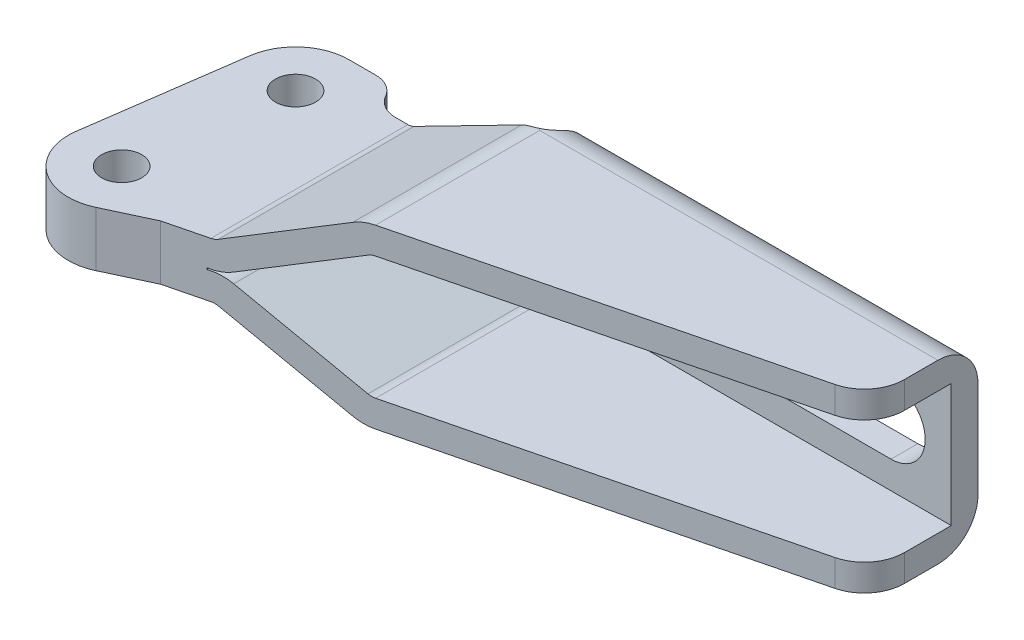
ISO-10303-21;
HEADER;
FILE_DESCRIPTION(('STEP AP214'),'2;1');
FILE_NAME('part.step','',(''),(''),'','','');
FILE_SCHEMA(('AUTOMOTIVE_DESIGN { 1 0 10303 214 1 1 1 1 }'));
ENDSEC;
DATA;
#1=APPLICATION_CONTEXT('core data for automotive mechanical design processes');
#2=APPLICATION_PROTOCOL_DEFINITION('international standard','automotive_design',2000,#1);
#3=PRODUCT_CONTEXT('',#1,'mechanical');
#4=PRODUCT('Part','Part','',(#3));
#5=PRODUCT_RELATED_PRODUCT_CATEGORY('part','',(#4));
#6=PRODUCT_DEFINITION_FORMATION('','',#4);
#7=PRODUCT_DEFINITION_CONTEXT('part definition',#1,'design');
#8=PRODUCT_DEFINITION('design','',#6,#7);
#9=PRODUCT_DEFINITION_SHAPE('','',#8);
#10=(LENGTH_UNIT() NAMED_UNIT(*) SI_UNIT(.MILLI.,.METRE.));
#11=(NAMED_UNIT(*) PLANE_ANGLE_UNIT() SI_UNIT($,.RADIAN.));
#12=(NAMED_UNIT(*) SI_UNIT($,.STERADIAN.) SOLID_ANGLE_UNIT());
#13=UNCERTAINTY_MEASURE_WITH_UNIT(LENGTH_MEASURE(1.E-05),#10,'distance_accuracy_value','');
#14=(GEOMETRIC_REPRESENTATION_CONTEXT(3) GLOBAL_UNCERTAINTY_ASSIGNED_CONTEXT((#13)) GLOBAL_UNIT_ASSIGNED_CONTEXT((#10,
#11,#12)) REPRESENTATION_CONTEXT('',''));
#15=CARTESIAN_POINT('',(0.,0.,0.));
#16=DIRECTION('',(0.,0.,1.));
#17=DIRECTION('',(1.,0.,0.));
#18=AXIS2_PLACEMENT_3D('',#15,#16,#17);
#19=CARTESIAN_POINT('',(-7.6,2.05,17.39));
#20=DIRECTION('',(0.,1.,0.));
#21=DIRECTION('',(0.,0.,-1.));
#22=AXIS2_PLACEMENT_3D('',#19,#20,#21);
#23=PLANE('',#22);
#24=CARTESIAN_POINT('',(0.,2.05,0.));
#25=DIRECTION('',(0.,1.,0.));
#26=DIRECTION('',(-1.,0.,0.));
#27=AXIS2_PLACEMENT_3D('',#24,#25,#26);
#28=CIRCLE('',#27,1.5);
#29=CARTESIAN_POINT('',(-1.5,2.05,0.));
#30=VERTEX_POINT('',#29);
#31=EDGE_CURVE('E696',#30,#30,#28,.T.);
#32=ORIENTED_EDGE('',*,*,#31,.F.);
#33=EDGE_LOOP('',(#32));
#34=FACE_BOUND('',#33,.T.);
#35=CARTESIAN_POINT('',(5.46410161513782,2.05,-4.00000000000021));
#36=DIRECTION('',(0.,1.,0.));
#37=DIRECTION('',(0.,0.,-1.));
#38=AXIS2_PLACEMENT_3D('',#35,#36,#37);
#39=CIRCLE('',#38,2.00000000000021);
#40=CARTESIAN_POINT('',(3.73205082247,2.05,-2.9999999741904));
#41=VERTEX_POINT('',#40);
#42=CARTESIAN_POINT('',(5.4641016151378,2.05,-2.));
#43=VERTEX_POINT('',#42);
#44=EDGE_CURVE('E1525',#41,#43,#39,.T.);
#45=ORIENTED_EDGE('',*,*,#44,.F.);
#46=CARTESIAN_POINT('',(2.00000000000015,2.05,-2.00000000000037));
#47=DIRECTION('',(0.,1.,0.));
#48=DIRECTION('',(0.,0.,-1.));
#49=AXIS2_PLACEMENT_3D('',#46,#47,#48);
#50=CIRCLE('',#49,1.99999999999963);
#51=CARTESIAN_POINT('',(2.,2.05,-4.));
#52=VERTEX_POINT('',#51);
#53=EDGE_CURVE('E1522',#52,#41,#50,.F.);
#54=ORIENTED_EDGE('',*,*,#53,.F.);
#55=DIRECTION('',(1.,0.,0.));
#56=VECTOR('',#55,1.);
#57=CARTESIAN_POINT('',(2.,2.05,-4.));
#58=LINE('',#57,#56);
#59=CARTESIAN_POINT('',(0.,2.05,-4.));
#60=VERTEX_POINT('',#59);
#61=EDGE_CURVE('E1519',#60,#52,#58,.T.);
#62=ORIENTED_EDGE('',*,*,#61,.F.);
#63=CARTESIAN_POINT('',(0.,2.05,0.));
#64=DIRECTION('',(0.,1.,0.));
#65=DIRECTION('',(0.,0.,-1.));
#66=AXIS2_PLACEMENT_3D('',#63,#64,#65);
#67=CIRCLE('',#66,4.);
#68=CARTESIAN_POINT('',(-3.9611086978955,2.05,-0.556433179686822));
#69=VERTEX_POINT('',#68);
#70=EDGE_CURVE('E1516',#69,#60,#67,.F.);
#71=ORIENTED_EDGE('',*,*,#70,.F.);
#72=DIRECTION('',(0.139108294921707,0.,-0.990277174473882));
#73=VECTOR('',#72,1.);
#74=CARTESIAN_POINT('',(-3.9611086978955,2.05,-0.556433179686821));
#75=LINE('',#74,#73);
#76=CARTESIAN_POINT('',(-5.5611086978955,2.05,10.833566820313));
#77=VERTEX_POINT('',#76);
#78=EDGE_CURVE('E1513',#77,#69,#75,.T.);
#79=ORIENTED_EDGE('',*,*,#78,.F.);
#80=CARTESIAN_POINT('',(-1.59999999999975,2.05,11.39));
#81=DIRECTION('',(0.,1.,0.));
#82=DIRECTION('',(0.,0.,-1.));
#83=AXIS2_PLACEMENT_3D('',#80,#81,#82);
#84=CIRCLE('',#83,4.00000000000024);
#85=CARTESIAN_POINT('',(0.0904730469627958,2.05,15.015231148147));
#86=VERTEX_POINT('',#85);
#87=EDGE_CURVE('E1508',#86,#77,#84,.F.);
#88=ORIENTED_EDGE('',*,*,#87,.F.);
#89=DIRECTION('',(-0.906307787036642,0.,0.422618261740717));
#90=VECTOR('',#89,1.);
#91=CARTESIAN_POINT('',(0.0904730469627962,2.05,15.015231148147));
#92=LINE('',#91,#90);
#93=CARTESIAN_POINT('',(3.3966212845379,2.05,13.47354890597));
#94=VERTEX_POINT('',#93);
#95=EDGE_CURVE('E1506',#94,#86,#92,.T.);
#96=ORIENTED_EDGE('',*,*,#95,.F.);
#97=DIRECTION('',(-0.970253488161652,0.,0.242091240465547));
#98=VECTOR('',#97,1.);
#99=CARTESIAN_POINT('',(3.3966212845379,2.05,13.47354890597));
#100=LINE('',#99,#98);
#101=CARTESIAN_POINT('',(6.4,2.05,12.7241656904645));
#102=VERTEX_POINT('',#101);
#103=EDGE_CURVE('E641',#102,#94,#100,.T.);
#104=ORIENTED_EDGE('',*,*,#103,.F.);
#105=DIRECTION('',(0.,0.,-1.));
#106=VECTOR('',#105,1.);
#107=CARTESIAN_POINT('',(6.4,2.05,17.39));
#108=LINE('',#107,#106);
#109=CARTESIAN_POINT('',(6.4,2.05,-2.));
#110=VERTEX_POINT('',#109);
#111=EDGE_CURVE('E470',#102,#110,#108,.T.);
#112=ORIENTED_EDGE('',*,*,#111,.T.);
#113=DIRECTION('',(1.,0.,0.));
#114=VECTOR('',#113,1.);
#115=CARTESIAN_POINT('',(15.5,2.05,-2.));
#116=LINE('',#115,#114);
#117=EDGE_CURVE('E1528',#43,#110,#116,.T.);
#118=ORIENTED_EDGE('',*,*,#117,.F.);
#119=EDGE_LOOP('',(#45,#54,#62,#71,#79,#88,#96,#104,#112,#118));
#120=FACE_BOUND('',#119,.T.);
#121=CARTESIAN_POINT('',(-1.6,2.05,11.39));
#122=DIRECTION('',(0.,1.,0.));
#123=DIRECTION('',(-1.,0.,0.));
#124=AXIS2_PLACEMENT_3D('',#121,#122,#123);
#125=CIRCLE('',#124,1.5);
#126=CARTESIAN_POINT('',(-3.1,2.05,11.39));
#127=VERTEX_POINT('',#126);
#128=EDGE_CURVE('E704',#127,#127,#125,.T.);
#129=ORIENTED_EDGE('',*,*,#128,.F.);
#130=EDGE_LOOP('',(#129));
#131=FACE_BOUND('',#130,.T.);
#132=ADVANCED_FACE('F14',(#34,#120,#131),#23,.T.);
#133=CARTESIAN_POINT('',(15.5000000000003,6.6,-3.49999999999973));
#134=DIRECTION('',(0.,-1.,0.));
#135=DIRECTION('',(1.,0.,0.));
#136=AXIS2_PLACEMENT_3D('',#133,#134,#135);
#137=PLANE('',#136);
#138=DIRECTION('',(-1.,0.,0.));
#139=VECTOR('',#138,1.);
#140=CARTESIAN_POINT('',(46.,6.6,-2.));
#141=LINE('',#140,#139);
#142=CARTESIAN_POINT('',(46.,6.6,-2.));
#143=VERTEX_POINT('',#142);
#144=CARTESIAN_POINT('',(16.2499999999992,6.6,-2.));
#145=VERTEX_POINT('',#144);
#146=EDGE_CURVE('E312',#143,#145,#141,.T.);
#147=ORIENTED_EDGE('',*,*,#146,.T.);
#148=DIRECTION('',(0.,0.,-1.));
#149=VECTOR('',#148,1.);
#150=CARTESIAN_POINT('',(16.25,6.6,17.39));
#151=LINE('',#150,#149);
#152=CARTESIAN_POINT('',(16.2499999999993,6.6,10.2664587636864));
#153=VERTEX_POINT('',#152);
#154=EDGE_CURVE('E459',#153,#145,#151,.T.);
#155=ORIENTED_EDGE('',*,*,#154,.F.);
#156=DIRECTION('',(0.970253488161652,0.,-0.242091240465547));
#157=VECTOR('',#156,1.);
#158=CARTESIAN_POINT('',(3.3966212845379,6.6,13.47354890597));
#159=LINE('',#158,#157);
#160=CARTESIAN_POINT('',(43.726273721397,6.6,3.410760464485));
#161=VERTEX_POINT('',#160);
#162=EDGE_CURVE('E565',#153,#161,#159,.T.);
#163=ORIENTED_EDGE('',*,*,#162,.T.);
#164=CARTESIAN_POINT('',(43.0000000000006,6.6,0.500000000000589));
#165=DIRECTION('',(0.,1.,0.));
#166=DIRECTION('',(-1.,0.,0.));
#167=AXIS2_PLACEMENT_3D('',#164,#165,#166);
#168=CIRCLE('',#167,2.99999999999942);
#169=CARTESIAN_POINT('',(46.,6.6,0.5));
#170=VERTEX_POINT('',#169);
#171=EDGE_CURVE('E568',#161,#170,#168,.T.);
#172=ORIENTED_EDGE('',*,*,#171,.T.);
#173=DIRECTION('',(0.,0.,-1.));
#174=VECTOR('',#173,1.);
#175=CARTESIAN_POINT('',(46.,6.6,0.5));
#176=LINE('',#175,#174);
#177=EDGE_CURVE('E564',#170,#143,#176,.T.);
#178=ORIENTED_EDGE('',*,*,#177,.T.);
#179=EDGE_LOOP('',(#147,#155,#163,#172,#178));
#180=FACE_BOUND('',#179,.T.);
#181=ADVANCED_FACE('F504',(#180),#137,.F.);
#182=CARTESIAN_POINT('',(15.5000000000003,-6.6,-3.49999999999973));
#183=DIRECTION('',(0.,-1.,0.));
#184=DIRECTION('',(1.,0.,0.));
#185=AXIS2_PLACEMENT_3D('',#182,#183,#184);
#186=PLANE('',#185);
#187=DIRECTION('',(0.,0.,-1.));
#188=VECTOR('',#187,1.);
#189=CARTESIAN_POINT('',(16.25,-6.6,17.39));
#190=LINE('',#189,#188);
#191=CARTESIAN_POINT('',(16.25,-6.6,10.2664587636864));
#192=VERTEX_POINT('',#191);
#193=CARTESIAN_POINT('',(16.25,-6.6,-1.99999999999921));
#194=VERTEX_POINT('',#193);
#195=EDGE_CURVE('E1539',#192,#194,#190,.T.);
#196=ORIENTED_EDGE('',*,*,#195,.T.);
#197=DIRECTION('',(-1.,0.,0.));
#198=VECTOR('',#197,1.);
#199=CARTESIAN_POINT('',(46.,-6.6,-2.));
#200=LINE('',#199,#198);
#201=CARTESIAN_POINT('',(46.,-6.6,-2.));
#202=VERTEX_POINT('',#201);
#203=EDGE_CURVE('E320',#202,#194,#200,.T.);
#204=ORIENTED_EDGE('',*,*,#203,.F.);
#205=DIRECTION('',(0.,0.,-1.));
#206=VECTOR('',#205,1.);
#207=CARTESIAN_POINT('',(46.,-6.6,0.5));
#208=LINE('',#207,#206);
#209=CARTESIAN_POINT('',(46.,-6.6,0.5));
#210=VERTEX_POINT('',#209);
#211=EDGE_CURVE('E571',#210,#202,#208,.T.);
#212=ORIENTED_EDGE('',*,*,#211,.F.);
#213=CARTESIAN_POINT('',(43.0000000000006,-6.6,0.500000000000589));
#214=DIRECTION('',(0.,1.,0.));
#215=DIRECTION('',(-1.,0.,0.));
#216=AXIS2_PLACEMENT_3D('',#213,#214,#215);
#217=CIRCLE('',#216,2.99999999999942);
#218=CARTESIAN_POINT('',(43.726273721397,-6.6,3.410760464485));
#219=VERTEX_POINT('',#218);
#220=EDGE_CURVE('E576',#219,#210,#217,.T.);
#221=ORIENTED_EDGE('',*,*,#220,.F.);
#222=DIRECTION('',(0.970253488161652,0.,-0.242091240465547));
#223=VECTOR('',#222,1.);
#224=CARTESIAN_POINT('',(3.3966212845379,-6.6,13.47354890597));
#225=LINE('',#224,#223);
#226=EDGE_CURVE('E574',#192,#219,#225,.T.);
#227=ORIENTED_EDGE('',*,*,#226,.F.);
#228=EDGE_LOOP('',(#196,#204,#212,#221,#227));
#229=FACE_BOUND('',#228,.T.);
#230=ADVANCED_FACE('F971',(#229),#186,.T.);
#231=CARTESIAN_POINT('',(46.,-6.6,-5.));
#232=DIRECTION('',(0.,0.,-1.));
#233=DIRECTION('',(0.,-1.,0.));
#234=AXIS2_PLACEMENT_3D('',#231,#232,#233);
#235=PLANE('',#234);
#236=DIRECTION('',(-1.,0.,0.));
#237=VECTOR('',#236,1.);
#238=CARTESIAN_POINT('',(46.,-2.55,-5.));
#239=LINE('',#238,#237);
#240=CARTESIAN_POINT('',(41.5,-2.55,-5.));
#241=VERTEX_POINT('',#240);
#242=CARTESIAN_POINT('',(21.5,-2.55,-5.));
#243=VERTEX_POINT('',#242);
#244=EDGE_CURVE('E301',#241,#243,#239,.T.);
#245=ORIENTED_EDGE('',*,*,#244,.F.);
#246=CARTESIAN_POINT('',(41.5,0.,-5.));
#247=DIRECTION('',(0.,0.,-1.));
#248=DIRECTION('',(0.,-1.,0.));
#249=AXIS2_PLACEMENT_3D('',#246,#247,#248);
#250=CIRCLE('',#249,2.55);
#251=CARTESIAN_POINT('',(41.5,2.55,-5.));
#252=VERTEX_POINT('',#251);
#253=EDGE_CURVE('E299',#252,#241,#250,.T.);
#254=ORIENTED_EDGE('',*,*,#253,.F.);
#255=DIRECTION('',(1.,0.,0.));
#256=VECTOR('',#255,1.);
#257=CARTESIAN_POINT('',(46.,2.55,-5.));
#258=LINE('',#257,#256);
#259=CARTESIAN_POINT('',(21.5,2.55,-5.));
#260=VERTEX_POINT('',#259);
#261=EDGE_CURVE('E284',#260,#252,#258,.T.);
#262=ORIENTED_EDGE('',*,*,#261,.F.);
#263=CARTESIAN_POINT('',(21.5,0.,-5.));
#264=DIRECTION('',(0.,0.,-1.));
#265=DIRECTION('',(0.,-1.,0.));
#266=AXIS2_PLACEMENT_3D('',#263,#264,#265);
#267=CIRCLE('',#266,2.55);
#268=EDGE_CURVE('E279',#243,#260,#267,.T.);
#269=ORIENTED_EDGE('',*,*,#268,.F.);
#270=EDGE_LOOP('',(#245,#254,#262,#269));
#271=FACE_BOUND('',#270,.T.);
#272=DIRECTION('',(-1.,0.,0.));
#273=VECTOR('',#272,1.);
#274=CARTESIAN_POINT('',(46.,-3.6,-5.));
#275=LINE('',#274,#273);
#276=CARTESIAN_POINT('',(46.,-3.6,-5.));
#277=VERTEX_POINT('',#276);
#278=CARTESIAN_POINT('',(17.,-3.6,-5.));
#279=VERTEX_POINT('',#278);
#280=EDGE_CURVE('E317',#277,#279,#275,.T.);
#281=ORIENTED_EDGE('',*,*,#280,.T.);
#282=DIRECTION('',(0.,1.,0.));
#283=VECTOR('',#282,1.);
#284=CARTESIAN_POINT('',(17.,-6.6,-5.));
#285=LINE('',#284,#283);
#286=CARTESIAN_POINT('',(17.,3.6,-5.));
#287=VERTEX_POINT('',#286);
#288=EDGE_CURVE('E620',#279,#287,#285,.T.);
#289=ORIENTED_EDGE('',*,*,#288,.T.);
#290=DIRECTION('',(-1.,0.,0.));
#291=VECTOR('',#290,1.);
#292=CARTESIAN_POINT('',(46.,3.6,-5.));
#293=LINE('',#292,#291);
#294=CARTESIAN_POINT('',(46.,3.6,-5.));
#295=VERTEX_POINT('',#294);
#296=EDGE_CURVE('E315',#295,#287,#293,.T.);
#297=ORIENTED_EDGE('',*,*,#296,.F.);
#298=DIRECTION('',(0.,1.,0.));
#299=VECTOR('',#298,1.);
#300=CARTESIAN_POINT('',(46.,-6.6,-5.));
#301=LINE('',#300,#299);
#302=EDGE_CURVE('E623',#277,#295,#301,.T.);
#303=ORIENTED_EDGE('',*,*,#302,.F.);
#304=EDGE_LOOP('',(#281,#289,#297,#303));
#305=FACE_BOUND('',#304,.T.);
#306=ADVANCED_FACE('F297',(#271,#305),#235,.T.);
#307=CARTESIAN_POINT('',(15.5000000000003,-6.6,-3.49999999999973));
#308=DIRECTION('',(0.,1.,0.));
#309=DIRECTION('',(-1.,0.,0.));
#310=AXIS2_PLACEMENT_3D('',#307,#308,#309);
#311=CYLINDRICAL_SURFACE('',#310,1.49999999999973);
#312=CARTESIAN_POINT('',(15.5,-6.6,-2.));
#313=CARTESIAN_POINT('',(15.5420973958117,-6.59999492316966,-2.00000029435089));
#314=CARTESIAN_POINT('',(15.5841746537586,-6.60000057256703,-2.00177330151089));
#315=CARTESIAN_POINT('',(15.6680299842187,-6.59999002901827,-2.00884669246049));
#316=CARTESIAN_POINT('',(15.7098080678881,-6.59997383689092,-2.01414694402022));
#317=CARTESIAN_POINT('',(15.8342106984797,-6.5998276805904,-2.03529481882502));
#318=CARTESIAN_POINT('',(15.9160055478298,-6.59960033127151,-2.05638965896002));
#319=CARTESIAN_POINT('',(16.0749076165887,-6.59803664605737,-2.11198693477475));
#320=CARTESIAN_POINT('',(16.1520119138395,-6.5966996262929,-2.1464976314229));
#321=CARTESIAN_POINT('',(16.2992969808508,-6.59160683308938,-2.2279162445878));
#322=CARTESIAN_POINT('',(16.3694788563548,-6.58785144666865,-2.27482217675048));
#323=CARTESIAN_POINT('',(16.5001402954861,-6.5764179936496,-2.37900541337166));
#324=CARTESIAN_POINT('',(16.5607119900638,-6.56878055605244,-2.43617140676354));
#325=CARTESIAN_POINT('',(16.6711581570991,-6.54808896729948,-2.55914516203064));
#326=CARTESIAN_POINT('',(16.7210410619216,-6.53503911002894,-2.62494604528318));
#327=CARTESIAN_POINT('',(16.8069931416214,-6.50298236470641,-2.75979730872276));
#328=CARTESIAN_POINT('',(16.8435447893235,-6.48424162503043,-2.82860388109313));
#329=CARTESIAN_POINT('',(16.9050666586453,-6.44006542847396,-2.96925839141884));
#330=CARTESIAN_POINT('',(16.9300250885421,-6.41462319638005,-3.04110934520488));
#331=CARTESIAN_POINT('',(16.9667007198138,-6.35973174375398,-3.17848925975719));
#332=CARTESIAN_POINT('',(16.9794305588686,-6.33087224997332,-3.24398711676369));
#333=CARTESIAN_POINT('',(16.9919166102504,-6.28379709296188,-3.34109338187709));
#334=CARTESIAN_POINT('',(16.9949773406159,-6.26748715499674,-3.37324988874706));
#335=CARTESIAN_POINT('',(16.9990186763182,-6.23366743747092,-3.43704546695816));
#336=CARTESIAN_POINT('',(17.0000000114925,-6.21615808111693,-3.46868471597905));
#337=CARTESIAN_POINT('',(17.,-6.19807621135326,-3.5));
#338=B_SPLINE_CURVE_WITH_KNOTS('',3,(#312,#313,#314,#315,#316,#317,#318,#319,#320,#321,#322,
#323,#324,#325,#326,#327,#328,#329,#330,#331,#332,#333,#334,#335,#336,#337),.UNSPECIFIED.,.F.,
.F.,(4,2,2,2,2,2,2,2,2,2,2,2,4),(0.,0.126214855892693,0.252424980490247,0.504543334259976,
0.756817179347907,1.00905066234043,1.2586970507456,1.50814576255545,1.74736802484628,
1.98683307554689,2.20410942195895,2.31259547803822,2.42104345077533),.UNSPECIFIED.);
#339=CARTESIAN_POINT('',(16.1171567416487,-6.59705733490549,-2.13284325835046));
#340=VERTEX_POINT('',#339);
#341=CARTESIAN_POINT('',(17.,-6.19807621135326,-3.5));
#342=VERTEX_POINT('',#341);
#343=EDGE_CURVE('E351',#340,#342,#338,.T.);
#344=ORIENTED_EDGE('',*,*,#343,.F.);
#345=CARTESIAN_POINT('',(16.25,-6.6,-2.20096189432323));
#346=CARTESIAN_POINT('',(16.2160918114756,-6.60000142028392,-2.18138463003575));
#347=CARTESIAN_POINT('',(16.1814319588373,-6.59942413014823,-2.16314606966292));
#348=CARTESIAN_POINT('',(16.1108215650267,-6.59697824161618,-2.1294417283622));
#349=CARTESIAN_POINT('',(16.0748706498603,-6.59510926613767,-2.11397675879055));
#350=CARTESIAN_POINT('',(15.9672546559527,-6.58749337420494,-2.07260255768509));
#351=CARTESIAN_POINT('',(15.8941070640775,-6.5797491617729,-2.05072855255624));
#352=CARTESIAN_POINT('',(15.7675702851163,-6.56143510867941,-2.0230710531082));
#353=CARTESIAN_POINT('',(15.7145527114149,-6.5523197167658,-2.01446860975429));
#354=CARTESIAN_POINT('',(15.6075653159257,-6.53092734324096,-2.00287466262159));
#355=CARTESIAN_POINT('',(15.553595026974,-6.51859794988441,-1.99998372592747));
#356=CARTESIAN_POINT('',(15.5,-6.50473750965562,-2.));
#357=B_SPLINE_CURVE_WITH_KNOTS('',3,(#345,#346,#347,#348,#349,#350,#351,#352,#353,#354,#355,
#356),.UNSPECIFIED.,.F.,.F.,(4,2,2,2,2,4),(0.,0.11738881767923,0.234811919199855,
0.463787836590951,0.626871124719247,0.792801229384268),.UNSPECIFIED.);
#358=CARTESIAN_POINT('',(15.5,-6.50473750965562,-2.));
#359=VERTEX_POINT('',#358);
#360=EDGE_CURVE('E525',#340,#359,#357,.T.);
#361=ORIENTED_EDGE('',*,*,#360,.T.);
#362=DIRECTION('',(0.,1.,0.));
#363=VECTOR('',#362,1.);
#364=CARTESIAN_POINT('',(15.5,-6.6,-2.));
#365=LINE('',#364,#363);
#366=CARTESIAN_POINT('',(15.5,-4.3394295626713,-2.));
#367=VERTEX_POINT('',#366);
#368=EDGE_CURVE('E614',#359,#367,#365,.T.);
#369=ORIENTED_EDGE('',*,*,#368,.T.);
#370=CARTESIAN_POINT('',(15.5000000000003,-4.33942956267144,-3.49999999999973));
#371=DIRECTION('',(0.455791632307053,0.890086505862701,0.));
#372=DIRECTION('',(-0.890086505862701,0.455791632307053,0.));
#373=AXIS2_PLACEMENT_3D('',#370,#371,#372);
#374=ELLIPSE('',#373,1.68522945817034,1.49999999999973);
#375=CARTESIAN_POINT('',(15.794208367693,-4.4900865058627,-2.02913581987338));
#376=VERTEX_POINT('',#375);
#377=EDGE_CURVE('E1578',#367,#376,#374,.T.);
#378=ORIENTED_EDGE('',*,*,#377,.T.);
#379=CARTESIAN_POINT('',(15.794208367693,-4.4900865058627,-2.02913581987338));
#380=CARTESIAN_POINT('',(15.816645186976,-4.50157831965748,-2.03362169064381));
#381=CARTESIAN_POINT('',(15.8394101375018,-4.51216127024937,-2.03871213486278));
#382=CARTESIAN_POINT('',(15.8853919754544,-4.53149494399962,-2.05016060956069));
#383=CARTESIAN_POINT('',(15.9086088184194,-4.54024584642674,-2.05651851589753));
#384=CARTESIAN_POINT('',(15.9775070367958,-4.56335272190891,-2.0772425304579));
#385=CARTESIAN_POINT('',(16.0235424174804,-4.57511846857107,-2.09347200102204));
#386=CARTESIAN_POINT('',(16.0996897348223,-4.58913029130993,-2.12469284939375));
#387=CARTESIAN_POINT('',(16.1300502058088,-4.59323570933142,-2.13833003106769));
#388=CARTESIAN_POINT('',(16.1904784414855,-4.59869558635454,-2.16793565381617));
#389=CARTESIAN_POINT('',(16.2205338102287,-4.60000511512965,-2.18393781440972));
#390=CARTESIAN_POINT('',(16.25,-4.6,-2.20096189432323));
#391=B_SPLINE_CURVE_WITH_KNOTS('',3,(#379,#380,#381,#382,#383,#384,#385,#386,#387,#388,#389,
#390),.UNSPECIFIED.,.F.,.F.,(4,2,2,2,2,4),(0.,0.0767598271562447,0.153512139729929,
0.303299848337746,0.403730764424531,0.505763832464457),.UNSPECIFIED.);
#392=CARTESIAN_POINT('',(16.25,-4.6,-2.20096189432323));
#393=VERTEX_POINT('',#392);
#394=EDGE_CURVE('E407',#376,#393,#391,.T.);
#395=ORIENTED_EDGE('',*,*,#394,.T.);
#396=CARTESIAN_POINT('',(15.5000000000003,-4.6,-3.49999999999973));
#397=DIRECTION('',(0.,1.,0.));
#398=DIRECTION('',(0.,0.,-1.));
#399=AXIS2_PLACEMENT_3D('',#396,#397,#398);
#400=CIRCLE('',#399,1.49999999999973);
#401=CARTESIAN_POINT('',(17.,-4.6,-3.5));
#402=VERTEX_POINT('',#401);
#403=EDGE_CURVE('E395',#393,#402,#400,.T.);
#404=ORIENTED_EDGE('',*,*,#403,.T.);
#405=DIRECTION('',(0.,1.,0.));
#406=VECTOR('',#405,1.);
#407=CARTESIAN_POINT('',(17.,-6.6,-3.5));
#408=LINE('',#407,#406);
#409=EDGE_CURVE('E618',#342,#402,#408,.T.);
#410=ORIENTED_EDGE('',*,*,#409,.F.);
#411=EDGE_LOOP('',(#344,#361,#369,#378,#395,#404,#410));
#412=FACE_BOUND('',#411,.T.);
#413=ADVANCED_FACE('F956',(#412),#311,.F.);
#414=CARTESIAN_POINT('',(17.,6.19807621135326,-3.5));
#415=CARTESIAN_POINT('',(17.0000037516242,6.21894200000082,-3.46387200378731));
#416=CARTESIAN_POINT('',(16.9986944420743,6.23904845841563,-3.42729350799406));
#417=CARTESIAN_POINT('',(16.9932843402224,6.27765475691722,-3.35347381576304));
#418=CARTESIAN_POINT('',(16.9891818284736,6.29615359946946,-3.31623222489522));
#419=CARTESIAN_POINT('',(16.9780119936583,6.33145463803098,-3.24131910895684));
#420=CARTESIAN_POINT('',(16.9709406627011,6.34825450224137,-3.20364706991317));
#421=CARTESIAN_POINT('',(16.953723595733,6.38005241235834,-3.1282668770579));
#422=CARTESIAN_POINT('',(16.9435785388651,6.39505085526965,-3.09055873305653));
#423=CARTESIAN_POINT('',(16.9082927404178,6.43739334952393,-2.97757320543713));
#424=CARTESIAN_POINT('',(16.8783352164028,6.46197247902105,-2.90267528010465));
#425=CARTESIAN_POINT('',(16.805748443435,6.50383340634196,-2.75728930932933));
#426=CARTESIAN_POINT('',(16.7631387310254,6.52112635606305,-2.68679466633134));
#427=CARTESIAN_POINT('',(16.6690563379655,6.54855225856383,-2.55694492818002));
#428=CARTESIAN_POINT('',(16.6182555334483,6.55904768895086,-2.49717786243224));
#429=CARTESIAN_POINT('',(16.5075515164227,6.5755963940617,-2.38599800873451));
#430=CARTESIAN_POINT('',(16.4476425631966,6.5816468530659,-2.33459053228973));
#431=CARTESIAN_POINT('',(16.319304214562,6.5906834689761,-2.24097122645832));
#432=CARTESIAN_POINT('',(16.2507509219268,6.59361760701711,-2.1989244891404));
#433=CARTESIAN_POINT('',(16.1077802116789,6.59756134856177,-2.12630577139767));
#434=CARTESIAN_POINT('',(16.0333627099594,6.59857092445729,-2.09573395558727));
#435=CARTESIAN_POINT('',(15.8832487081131,6.59971384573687,-2.04772411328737));
#436=CARTESIAN_POINT('',(15.8076884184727,6.59987665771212,-2.02986337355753));
#437=CARTESIAN_POINT('',(15.6930202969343,6.59998128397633,-2.01196574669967));
#438=CARTESIAN_POINT('',(15.6545594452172,6.59999286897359,-2.00748210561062));
#439=CARTESIAN_POINT('',(15.577404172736,6.60000040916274,-2.0014991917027));
#440=CARTESIAN_POINT('',(15.5387097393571,6.59999636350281,-2.00000008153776));
#441=CARTESIAN_POINT('',(15.5,6.6,-2.));
#442=B_SPLINE_CURVE_WITH_KNOTS('',3,(#414,#415,#416,#417,#418,#419,#420,#421,#422,#423,#424,
#425,#426,#427,#428,#429,#430,#431,#432,#433,#434,#435,#436,#437,#438,#439,#440,#441),
.UNSPECIFIED.,.F.,.F.,(4,2,2,2,2,2,2,2,2,2,2,2,2,4),(0.,0.125146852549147,0.250370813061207,
0.375764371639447,0.501130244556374,0.752653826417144,1.00379102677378,1.24009962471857,
1.47655778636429,1.71690378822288,1.95725323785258,2.18917993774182,2.3052433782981,
2.42131314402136),.UNSPECIFIED.);
#443=CARTESIAN_POINT('',(17.,6.19807621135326,-3.5));
#444=VERTEX_POINT('',#443);
#445=CARTESIAN_POINT('',(16.1171567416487,6.59705733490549,-2.13284325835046));
#446=VERTEX_POINT('',#445);
#447=EDGE_CURVE('E322',#444,#446,#442,.T.);
#448=ORIENTED_EDGE('',*,*,#447,.F.);
#449=CARTESIAN_POINT('',(17.,4.6,-3.5));
#450=VERTEX_POINT('',#449);
#451=EDGE_CURVE('E617',#450,#444,#408,.T.);
#452=ORIENTED_EDGE('',*,*,#451,.F.);
#453=CARTESIAN_POINT('',(15.5000000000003,4.6,-3.49999999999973));
#454=DIRECTION('',(0.,-1.,0.));
#455=DIRECTION('',(0.,0.,1.));
#456=AXIS2_PLACEMENT_3D('',#453,#454,#455);
#457=CIRCLE('',#456,1.49999999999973);
#458=CARTESIAN_POINT('',(16.25,4.6,-2.20096189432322));
#459=VERTEX_POINT('',#458);
#460=EDGE_CURVE('E404',#450,#459,#457,.T.);
#461=ORIENTED_EDGE('',*,*,#460,.T.);
#462=CARTESIAN_POINT('',(16.25,4.6,-2.20096189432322));
#463=CARTESIAN_POINT('',(16.2278173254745,4.59999957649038,-2.18815311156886));
#464=CARTESIAN_POINT('',(16.2053117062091,4.59926070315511,-2.17591986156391));
#465=CARTESIAN_POINT('',(16.1597755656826,4.5961837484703,-2.15265041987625));
#466=CARTESIAN_POINT('',(16.1367446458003,4.5938444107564,-2.14161517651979));
#467=CARTESIAN_POINT('',(16.0682562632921,4.58440308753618,-2.1109231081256));
#468=CARTESIAN_POINT('',(16.0222821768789,4.5748877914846,-2.09303693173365));
#469=CARTESIAN_POINT('',(15.9458649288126,4.553162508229,-2.06743117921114));
#470=CARTESIAN_POINT('',(15.9153184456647,4.54288723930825,-2.05830613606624));
#471=CARTESIAN_POINT('',(15.8543818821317,4.5190104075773,-2.0421142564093));
#472=CARTESIAN_POINT('',(15.8240023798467,4.50535758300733,-2.03508321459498));
#473=CARTESIAN_POINT('',(15.794208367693,4.4900865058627,-2.02913581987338));
#474=B_SPLINE_CURVE_WITH_KNOTS('',3,(#462,#463,#464,#465,#466,#467,#468,#469,#470,#471,#472,
#473),.UNSPECIFIED.,.F.,.F.,(4,2,2,2,2,4),(0.,0.0768061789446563,0.153672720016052,
0.303573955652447,0.403853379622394,0.50575975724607),.UNSPECIFIED.);
#475=CARTESIAN_POINT('',(15.794208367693,4.4900865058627,-2.02913581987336));
#476=VERTEX_POINT('',#475);
#477=EDGE_CURVE('E451',#459,#476,#474,.T.);
#478=ORIENTED_EDGE('',*,*,#477,.T.);
#479=CARTESIAN_POINT('',(15.5000000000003,4.33942956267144,-3.49999999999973));
#480=DIRECTION('',(0.455791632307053,-0.890086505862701,0.));
#481=DIRECTION('',(0.890086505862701,0.455791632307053,0.));
#482=AXIS2_PLACEMENT_3D('',#479,#480,#481);
#483=ELLIPSE('',#482,1.68522945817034,1.49999999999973);
#484=CARTESIAN_POINT('',(15.5,4.3394295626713,-2.));
#485=VERTEX_POINT('',#484);
#486=EDGE_CURVE('E460',#476,#485,#483,.T.);
#487=ORIENTED_EDGE('',*,*,#486,.T.);
#488=CARTESIAN_POINT('',(15.5,6.50473750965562,-2.));
#489=VERTEX_POINT('',#488);
#490=EDGE_CURVE('E613',#485,#489,#365,.T.);
#491=ORIENTED_EDGE('',*,*,#490,.T.);
#492=CARTESIAN_POINT('',(15.5,6.50473750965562,-2.));
#493=CARTESIAN_POINT('',(15.5379090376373,6.51452882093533,-1.99999947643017));
#494=CARTESIAN_POINT('',(15.5759947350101,6.52356657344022,-2.00143873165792));
#495=CARTESIAN_POINT('',(15.6522840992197,6.54011190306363,-2.00725908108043));
#496=CARTESIAN_POINT('',(15.6904877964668,6.54761904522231,-2.01164100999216));
#497=CARTESIAN_POINT('',(15.8029849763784,6.56746613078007,-2.02899912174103));
#498=CARTESIAN_POINT('',(15.8770834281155,6.57762165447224,-2.04618516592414));
#499=CARTESIAN_POINT('',(16.0013121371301,6.59012807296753,-2.08521027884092));
#500=CARTESIAN_POINT('',(16.0522035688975,6.59388390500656,-2.10428718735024));
#501=CARTESIAN_POINT('',(16.1525997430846,6.59885005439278,-2.14826851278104));
#502=CARTESIAN_POINT('',(16.2020647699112,6.60001479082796,-2.17326884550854));
#503=CARTESIAN_POINT('',(16.25,6.6,-2.20096189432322));
#504=B_SPLINE_CURVE_WITH_KNOTS('',3,(#492,#493,#494,#495,#496,#497,#498,#499,#500,#501,#502,
#503),.UNSPECIFIED.,.F.,.F.,(4,2,2,2,2,4),(0.,0.117387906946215,0.234809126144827,
0.463785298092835,0.626869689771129,0.792801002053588),.UNSPECIFIED.);
#505=EDGE_CURVE('E479',#489,#446,#504,.T.);
#506=ORIENTED_EDGE('',*,*,#505,.T.);
#507=EDGE_LOOP('',(#448,#452,#461,#478,#487,#491,#506));
#508=FACE_BOUND('',#507,.T.);
#509=ADVANCED_FACE('F332',(#508),#311,.F.);
#510=CARTESIAN_POINT('',(15.5,-6.6,-2.));
#511=DIRECTION('',(0.,0.,-1.));
#512=DIRECTION('',(0.,-1.,0.));
#513=AXIS2_PLACEMENT_3D('',#510,#511,#512);
#514=PLANE('',#513);
#515=ORIENTED_EDGE('',*,*,#490,.F.);
#516=DIRECTION('',(-0.890086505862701,-0.455791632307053,0.));
#517=VECTOR('',#516,1.);
#518=CARTESIAN_POINT('',(11.0619392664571,2.06680669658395,-2.));
#519=LINE('',#518,#517);
#520=CARTESIAN_POINT('',(7.7673748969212,0.37974048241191,-2.));
#521=VERTEX_POINT('',#520);
#522=EDGE_CURVE('E1591',#485,#521,#519,.T.);
#523=ORIENTED_EDGE('',*,*,#522,.T.);
#524=CARTESIAN_POINT('',(6.4,3.04999999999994,-2.));
#525=DIRECTION('',(0.,0.,-1.));
#526=DIRECTION('',(0.,-1.,0.));
#527=AXIS2_PLACEMENT_3D('',#524,#525,#526);
#528=CIRCLE('',#527,2.99999999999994);
#529=CARTESIAN_POINT('',(6.1552552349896,0.0600000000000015,-2.));
#530=VERTEX_POINT('',#529);
#531=EDGE_CURVE('E1589',#521,#530,#528,.T.);
#532=ORIENTED_EDGE('',*,*,#531,.T.);
#533=DIRECTION('',(0.,-1.,0.));
#534=VECTOR('',#533,1.);
#535=CARTESIAN_POINT('',(6.1552552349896,-6.6,-2.));
#536=LINE('',#535,#534);
#537=CARTESIAN_POINT('',(6.1552552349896,-0.06,-2.));
#538=VERTEX_POINT('',#537);
#539=EDGE_CURVE('E1587',#530,#538,#536,.T.);
#540=ORIENTED_EDGE('',*,*,#539,.T.);
#541=CARTESIAN_POINT('',(6.4,-3.05000000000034,-2.));
#542=DIRECTION('',(0.,0.,-1.));
#543=DIRECTION('',(0.,-1.,0.));
#544=AXIS2_PLACEMENT_3D('',#541,#542,#543);
#545=CIRCLE('',#544,3.00000000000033);
#546=CARTESIAN_POINT('',(7.7673748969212,-0.3797404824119,-2.));
#547=VERTEX_POINT('',#546);
#548=EDGE_CURVE('E1583',#538,#547,#545,.T.);
#549=ORIENTED_EDGE('',*,*,#548,.T.);
#550=DIRECTION('',(0.890086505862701,-0.455791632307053,0.));
#551=VECTOR('',#550,1.);
#552=CARTESIAN_POINT('',(16.4170998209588,-4.80905405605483,-2.));
#553=LINE('',#552,#551);
#554=EDGE_CURVE('E415',#547,#367,#553,.T.);
#555=ORIENTED_EDGE('',*,*,#554,.T.);
#556=ORIENTED_EDGE('',*,*,#368,.F.);
#557=CARTESIAN_POINT('',(16.2499999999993,-3.60000000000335,-2.));
#558=DIRECTION('',(0.,0.,-1.));
#559=DIRECTION('',(0.,-1.,0.));
#560=AXIS2_PLACEMENT_3D('',#557,#558,#559);
#561=CIRCLE('',#560,2.99999999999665);
#562=CARTESIAN_POINT('',(14.882625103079,-6.2702595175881,-2.));
#563=VERTEX_POINT('',#562);
#564=EDGE_CURVE('E533',#359,#563,#561,.T.);
#565=ORIENTED_EDGE('',*,*,#564,.T.);
#566=DIRECTION('',(-0.890086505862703,0.455791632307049,0.));
#567=VECTOR('',#566,1.);
#568=CARTESIAN_POINT('',(15.5055165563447,-6.58922706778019,-2.));
#569=LINE('',#568,#567);
#570=CARTESIAN_POINT('',(6.8557916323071,-2.1599134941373,-2.));
#571=VERTEX_POINT('',#570);
#572=EDGE_CURVE('E561',#563,#571,#569,.T.);
#573=ORIENTED_EDGE('',*,*,#572,.T.);
#574=CARTESIAN_POINT('',(6.40000000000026,-3.04999999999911,-2.));
#575=DIRECTION('',(0.,0.,-1.));
#576=DIRECTION('',(0.,-1.,0.));
#577=AXIS2_PLACEMENT_3D('',#574,#575,#576);
#578=CIRCLE('',#577,0.999999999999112);
#579=CARTESIAN_POINT('',(6.4,-2.05,-2.));
#580=VERTEX_POINT('',#579);
#581=EDGE_CURVE('E558',#571,#580,#578,.F.);
#582=ORIENTED_EDGE('',*,*,#581,.T.);
#583=DIRECTION('',(-1.,0.,0.));
#584=VECTOR('',#583,1.);
#585=CARTESIAN_POINT('',(15.5,-2.05,-2.));
#586=LINE('',#585,#584);
#587=CARTESIAN_POINT('',(5.46410161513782,-2.05,-2.));
#588=VERTEX_POINT('',#587);
#589=EDGE_CURVE('E555',#580,#588,#586,.T.);
#590=ORIENTED_EDGE('',*,*,#589,.T.);
#591=DIRECTION('',(0.,1.,0.));
#592=VECTOR('',#591,1.);
#593=CARTESIAN_POINT('',(5.4641016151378,-6.6,-2.));
#594=LINE('',#593,#592);
#595=EDGE_CURVE('E610',#588,#43,#594,.T.);
#596=ORIENTED_EDGE('',*,*,#595,.T.);
#597=ORIENTED_EDGE('',*,*,#117,.T.);
#598=CARTESIAN_POINT('',(6.40000000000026,3.04999999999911,-2.));
#599=DIRECTION('',(0.,0.,-1.));
#600=DIRECTION('',(0.,-1.,0.));
#601=AXIS2_PLACEMENT_3D('',#598,#599,#600);
#602=CIRCLE('',#601,0.999999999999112);
#603=CARTESIAN_POINT('',(6.8557916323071,2.1599134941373,-2.));
#604=VERTEX_POINT('',#603);
#605=EDGE_CURVE('E1504',#110,#604,#602,.F.);
#606=ORIENTED_EDGE('',*,*,#605,.T.);
#607=DIRECTION('',(0.890086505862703,0.455791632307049,0.));
#608=VECTOR('',#607,1.);
#609=CARTESIAN_POINT('',(10.150356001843,3.84697970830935,-2.));
#610=LINE('',#609,#608);
#611=CARTESIAN_POINT('',(14.882625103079,6.2702595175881,-2.));
#612=VERTEX_POINT('',#611);
#613=EDGE_CURVE('E486',#604,#612,#610,.T.);
#614=ORIENTED_EDGE('',*,*,#613,.T.);
#615=CARTESIAN_POINT('',(16.2499999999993,3.60000000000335,-2.));
#616=DIRECTION('',(0.,0.,-1.));
#617=DIRECTION('',(0.,-1.,0.));
#618=AXIS2_PLACEMENT_3D('',#615,#616,#617);
#619=CIRCLE('',#618,2.99999999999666);
#620=EDGE_CURVE('E476',#612,#489,#619,.T.);
#621=ORIENTED_EDGE('',*,*,#620,.T.);
#622=EDGE_LOOP('',(#515,#523,#532,#540,#549,#555,#556,#565,#573,#582,#590,#596,#597,#606,#614,#621));
#623=FACE_BOUND('',#622,.T.);
#624=ADVANCED_FACE('F940',(#623),#514,.T.);
#625=CARTESIAN_POINT('',(3.3966212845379,-6.6,13.47354890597));
#626=DIRECTION('',(0.242091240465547,0.,0.970253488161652));
#627=DIRECTION('',(0.970253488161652,0.,-0.242091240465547));
#628=AXIS2_PLACEMENT_3D('',#625,#626,#627);
#629=PLANE('',#628);
#630=CARTESIAN_POINT('',(16.2499999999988,3.600000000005,10.2664587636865));
#631=DIRECTION('',(0.242091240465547,0.,0.970253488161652));
#632=DIRECTION('',(0.970253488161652,0.,-0.242091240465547));
#633=AXIS2_PLACEMENT_3D('',#630,#631,#632);
#634=ELLIPSE('',#633,1.03065849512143,0.999999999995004);
#635=CARTESIAN_POINT('',(15.794208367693,4.4900865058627,10.3801848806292));
#636=VERTEX_POINT('',#635);
#637=CARTESIAN_POINT('',(16.25,4.6,10.2664587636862));
#638=VERTEX_POINT('',#637);
#639=EDGE_CURVE('E671',#636,#638,#634,.F.);
#640=ORIENTED_EDGE('',*,*,#639,.T.);
#641=DIRECTION('',(0.970253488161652,0.,-0.242091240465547));
#642=VECTOR('',#641,1.);
#643=CARTESIAN_POINT('',(3.3966212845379,4.6,13.47354890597));
#644=LINE('',#643,#642);
#645=CARTESIAN_POINT('',(43.726273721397,4.6,3.410760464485));
#646=VERTEX_POINT('',#645);
#647=EDGE_CURVE('E401',#638,#646,#644,.T.);
#648=ORIENTED_EDGE('',*,*,#647,.T.);
#649=DIRECTION('',(0.,1.,0.));
#650=VECTOR('',#649,1.);
#651=CARTESIAN_POINT('',(43.726273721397,-6.6,3.410760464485));
#652=LINE('',#651,#650);
#653=EDGE_CURVE('E585',#646,#161,#652,.T.);
#654=ORIENTED_EDGE('',*,*,#653,.T.);
#655=ORIENTED_EDGE('',*,*,#162,.F.);
#656=CARTESIAN_POINT('',(16.2499999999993,3.60000000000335,10.2664587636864));
#657=DIRECTION('',(0.242091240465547,0.,0.970253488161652));
#658=DIRECTION('',(0.970253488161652,0.,-0.242091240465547));
#659=AXIS2_PLACEMENT_3D('',#656,#657,#658);
#660=ELLIPSE('',#659,3.09197548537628,2.99999999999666);
#661=CARTESIAN_POINT('',(14.882625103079,6.2702595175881,10.6076371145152));
#662=VERTEX_POINT('',#661);
#663=EDGE_CURVE('E473',#153,#662,#660,.T.);
#664=ORIENTED_EDGE('',*,*,#663,.T.);
#665=DIRECTION('',(-0.868915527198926,-0.444950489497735,0.216806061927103));
#666=VECTOR('',#665,1.);
#667=CARTESIAN_POINT('',(0.6946748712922,-0.995044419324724,14.1477207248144));
#668=LINE('',#667,#666);
#669=CARTESIAN_POINT('',(6.8557916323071,2.1599134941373,12.6104395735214));
#670=VERTEX_POINT('',#669);
#671=EDGE_CURVE('E635',#662,#670,#668,.T.);
#672=ORIENTED_EDGE('',*,*,#671,.T.);
#673=CARTESIAN_POINT('',(6.40000000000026,3.04999999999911,12.7241656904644));
#674=DIRECTION('',(0.242091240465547,0.,0.970253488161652));
#675=DIRECTION('',(0.970253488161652,0.,-0.242091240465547));
#676=AXIS2_PLACEMENT_3D('',#673,#674,#675);
#677=ELLIPSE('',#676,1.03065849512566,0.999999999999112);
#678=EDGE_CURVE('E638',#670,#102,#677,.F.);
#679=ORIENTED_EDGE('',*,*,#678,.T.);
#680=ORIENTED_EDGE('',*,*,#103,.T.);
#681=DIRECTION('',(0.,1.,0.));
#682=VECTOR('',#681,1.);
#683=CARTESIAN_POINT('',(3.3966212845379,-6.6,13.47354890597));
#684=LINE('',#683,#682);
#685=CARTESIAN_POINT('',(3.3966212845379,-2.05,13.47354890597));
#686=VERTEX_POINT('',#685);
#687=EDGE_CURVE('E589',#686,#94,#684,.T.);
#688=ORIENTED_EDGE('',*,*,#687,.F.);
#689=DIRECTION('',(0.970253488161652,0.,-0.242091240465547));
#690=VECTOR('',#689,1.);
#691=CARTESIAN_POINT('',(3.3966212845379,-2.05,13.47354890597));
#692=LINE('',#691,#690);
#693=CARTESIAN_POINT('',(6.4,-2.05,12.7241656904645));
#694=VERTEX_POINT('',#693);
#695=EDGE_CURVE('E626',#686,#694,#692,.T.);
#696=ORIENTED_EDGE('',*,*,#695,.T.);
#697=CARTESIAN_POINT('',(6.40000000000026,-3.04999999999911,12.7241656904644));
#698=DIRECTION('',(0.242091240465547,0.,0.970253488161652));
#699=DIRECTION('',(0.970253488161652,0.,-0.242091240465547));
#700=AXIS2_PLACEMENT_3D('',#697,#698,#699);
#701=ELLIPSE('',#700,1.03065849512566,0.999999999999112);
#702=CARTESIAN_POINT('',(6.8557916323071,-2.1599134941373,12.6104395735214));
#703=VERTEX_POINT('',#702);
#704=EDGE_CURVE('E629',#694,#703,#701,.F.);
#705=ORIENTED_EDGE('',*,*,#704,.T.);
#706=DIRECTION('',(0.868915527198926,-0.444950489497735,-0.216806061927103));
#707=VECTOR('',#706,1.);
#708=CARTESIAN_POINT('',(5.79811680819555,-1.61830396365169,12.8743436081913));
#709=LINE('',#708,#707);
#710=CARTESIAN_POINT('',(14.882625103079,-6.2702595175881,10.6076371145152));
#711=VERTEX_POINT('',#710);
#712=EDGE_CURVE('E632',#703,#711,#709,.T.);
#713=ORIENTED_EDGE('',*,*,#712,.T.);
#714=CARTESIAN_POINT('',(16.2499999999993,-3.60000000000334,10.2664587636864));
#715=DIRECTION('',(0.242091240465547,0.,0.970253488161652));
#716=DIRECTION('',(0.970253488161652,0.,-0.242091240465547));
#717=AXIS2_PLACEMENT_3D('',#714,#715,#716);
#718=ELLIPSE('',#717,3.09197548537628,2.99999999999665);
#719=EDGE_CURVE('E1541',#711,#192,#718,.T.);
#720=ORIENTED_EDGE('',*,*,#719,.T.);
#721=ORIENTED_EDGE('',*,*,#226,.T.);
#722=CARTESIAN_POINT('',(43.726273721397,-4.6,3.410760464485));
#723=VERTEX_POINT('',#722);
#724=EDGE_CURVE('E586',#219,#723,#652,.T.);
#725=ORIENTED_EDGE('',*,*,#724,.T.);
#726=DIRECTION('',(-0.970253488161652,0.,0.242091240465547));
#727=VECTOR('',#726,1.);
#728=CARTESIAN_POINT('',(3.3966212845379,-4.6,13.47354890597));
#729=LINE('',#728,#727);
#730=CARTESIAN_POINT('',(16.25,-4.6,10.2664587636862));
#731=VERTEX_POINT('',#730);
#732=EDGE_CURVE('E392',#723,#731,#729,.T.);
#733=ORIENTED_EDGE('',*,*,#732,.T.);
#734=CARTESIAN_POINT('',(16.2499999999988,-3.600000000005,10.2664587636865));
#735=DIRECTION('',(0.242091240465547,0.,0.970253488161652));
#736=DIRECTION('',(0.970253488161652,0.,-0.242091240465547));
#737=AXIS2_PLACEMENT_3D('',#734,#735,#736);
#738=ELLIPSE('',#737,1.03065849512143,0.999999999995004);
#739=CARTESIAN_POINT('',(15.794208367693,-4.4900865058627,10.3801848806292));
#740=VERTEX_POINT('',#739);
#741=EDGE_CURVE('E653',#731,#740,#738,.F.);
#742=ORIENTED_EDGE('',*,*,#741,.T.);
#743=DIRECTION('',(-0.868915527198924,0.44495048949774,0.216806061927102));
#744=VECTOR('',#743,1.);
#745=CARTESIAN_POINT('',(6.66685122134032,0.183810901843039,12.6575827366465));
#746=LINE('',#745,#744);
#747=CARTESIAN_POINT('',(7.7673748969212,-0.379740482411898,12.3829873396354));
#748=VERTEX_POINT('',#747);
#749=EDGE_CURVE('E656',#740,#748,#746,.T.);
#750=ORIENTED_EDGE('',*,*,#749,.T.);
#751=CARTESIAN_POINT('',(6.4,-3.05000000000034,12.7241656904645));
#752=DIRECTION('',(0.242091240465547,0.,0.970253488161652));
#753=DIRECTION('',(0.970253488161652,0.,-0.242091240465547));
#754=AXIS2_PLACEMENT_3D('',#751,#752,#753);
#755=ELLIPSE('',#754,3.09197548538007,3.00000000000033);
#756=CARTESIAN_POINT('',(6.1552552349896,-0.0599999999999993,12.7852327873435));
#757=VERTEX_POINT('',#756);
#758=EDGE_CURVE('E659',#748,#757,#755,.T.);
#759=ORIENTED_EDGE('',*,*,#758,.T.);
#760=DIRECTION('',(0.,1.,0.));
#761=VECTOR('',#760,1.);
#762=CARTESIAN_POINT('',(6.1552552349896,-6.6,12.7852327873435));
#763=LINE('',#762,#761);
#764=CARTESIAN_POINT('',(6.1552552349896,0.0600000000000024,12.7852327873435));
#765=VERTEX_POINT('',#764);
#766=EDGE_CURVE('E662',#757,#765,#763,.T.);
#767=ORIENTED_EDGE('',*,*,#766,.T.);
#768=CARTESIAN_POINT('',(6.4,3.04999999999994,12.7241656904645));
#769=DIRECTION('',(0.242091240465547,0.,0.970253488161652));
#770=DIRECTION('',(0.970253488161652,0.,-0.242091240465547));
#771=AXIS2_PLACEMENT_3D('',#768,#769,#770);
#772=ELLIPSE('',#771,3.09197548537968,2.99999999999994);
#773=CARTESIAN_POINT('',(7.7673748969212,0.379740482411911,12.3829873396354));
#774=VERTEX_POINT('',#773);
#775=EDGE_CURVE('E665',#765,#774,#772,.T.);
#776=ORIENTED_EDGE('',*,*,#775,.T.);
#777=DIRECTION('',(0.868915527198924,0.444950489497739,-0.216806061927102));
#778=VECTOR('',#777,1.);
#779=CARTESIAN_POINT('',(1.56340928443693,-2.79715928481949,13.9309598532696));
#780=LINE('',#779,#778);
#781=EDGE_CURVE('E668',#774,#636,#780,.T.);
#782=ORIENTED_EDGE('',*,*,#781,.T.);
#783=EDGE_LOOP('',(#640,#648,#654,#655,#664,#672,#679,#680,#688,#696,#705,#713,#720,#721,#725,
#733,#742,#750,#759,#767,#776,#782));
#784=FACE_BOUND('',#783,.T.);
#785=ADVANCED_FACE('F932',(#784),#629,.T.);
#786=CARTESIAN_POINT('',(46.,-6.6,0.5));
#787=DIRECTION('',(1.,0.,0.));
#788=DIRECTION('',(0.,1.,0.));
#789=AXIS2_PLACEMENT_3D('',#786,#787,#788);
#790=PLANE('',#789);
#791=CARTESIAN_POINT('',(46.,-3.59999999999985,-1.99999999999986));
#792=DIRECTION('',(1.,0.,0.));
#793=DIRECTION('',(0.,0.,1.));
#794=AXIS2_PLACEMENT_3D('',#791,#792,#793);
#795=CIRCLE('',#794,3.00000000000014);
#796=EDGE_CURVE('E306',#202,#277,#795,.T.);
#797=ORIENTED_EDGE('',*,*,#796,.T.);
#798=ORIENTED_EDGE('',*,*,#302,.T.);
#799=CARTESIAN_POINT('',(46.,3.59999999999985,-1.99999999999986));
#800=DIRECTION('',(1.,0.,0.));
#801=DIRECTION('',(0.,0.,1.));
#802=AXIS2_PLACEMENT_3D('',#799,#800,#801);
#803=CIRCLE('',#802,3.00000000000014);
#804=EDGE_CURVE('E309',#295,#143,#803,.T.);
#805=ORIENTED_EDGE('',*,*,#804,.T.);
#806=ORIENTED_EDGE('',*,*,#177,.F.);
#807=DIRECTION('',(0.,1.,0.));
#808=VECTOR('',#807,1.);
#809=CARTESIAN_POINT('',(46.,-6.6,0.5));
#810=LINE('',#809,#808);
#811=CARTESIAN_POINT('',(46.,4.6,0.5));
#812=VERTEX_POINT('',#811);
#813=EDGE_CURVE('E579',#812,#170,#810,.T.);
#814=ORIENTED_EDGE('',*,*,#813,.F.);
#815=DIRECTION('',(0.,0.,-1.));
#816=VECTOR('',#815,1.);
#817=CARTESIAN_POINT('',(46.,4.6,0.5));
#818=LINE('',#817,#816);
#819=CARTESIAN_POINT('',(46.,4.6,-3.));
#820=VERTEX_POINT('',#819);
#821=EDGE_CURVE('E398',#812,#820,#818,.T.);
#822=ORIENTED_EDGE('',*,*,#821,.T.);
#823=DIRECTION('',(0.,-1.,0.));
#824=VECTOR('',#823,1.);
#825=CARTESIAN_POINT('',(46.,-6.6,-3.));
#826=LINE('',#825,#824);
#827=CARTESIAN_POINT('',(46.,-4.6,-3.));
#828=VERTEX_POINT('',#827);
#829=EDGE_CURVE('E650',#820,#828,#826,.T.);
#830=ORIENTED_EDGE('',*,*,#829,.T.);
#831=DIRECTION('',(0.,0.,1.));
#832=VECTOR('',#831,1.);
#833=CARTESIAN_POINT('',(46.,-4.6,0.5));
#834=LINE('',#833,#832);
#835=CARTESIAN_POINT('',(46.,-4.6,0.5));
#836=VERTEX_POINT('',#835);
#837=EDGE_CURVE('E389',#828,#836,#834,.T.);
#838=ORIENTED_EDGE('',*,*,#837,.T.);
#839=EDGE_CURVE('E582',#210,#836,#810,.T.);
#840=ORIENTED_EDGE('',*,*,#839,.F.);
#841=ORIENTED_EDGE('',*,*,#211,.T.);
#842=EDGE_LOOP('',(#797,#798,#805,#806,#814,#822,#830,#838,#840,#841));
#843=FACE_BOUND('',#842,.T.);
#844=ADVANCED_FACE('F16',(#843),#790,.T.);
#845=CARTESIAN_POINT('',(43.0000000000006,-6.6,0.500000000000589));
#846=DIRECTION('',(0.,1.,0.));
#847=DIRECTION('',(-1.,0.,0.));
#848=AXIS2_PLACEMENT_3D('',#845,#846,#847);
#849=CYLINDRICAL_SURFACE('',#848,2.99999999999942);
#850=ORIENTED_EDGE('',*,*,#653,.F.);
#851=CARTESIAN_POINT('',(43.0000000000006,4.6,0.500000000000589));
#852=DIRECTION('',(0.,-1.,0.));
#853=DIRECTION('',(0.,0.,1.));
#854=AXIS2_PLACEMENT_3D('',#851,#852,#853);
#855=CIRCLE('',#854,2.99999999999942);
#856=EDGE_CURVE('E647',#646,#812,#855,.F.);
#857=ORIENTED_EDGE('',*,*,#856,.T.);
#858=ORIENTED_EDGE('',*,*,#813,.T.);
#859=ORIENTED_EDGE('',*,*,#171,.F.);
#860=EDGE_LOOP('',(#850,#857,#858,#859));
#861=FACE_BOUND('',#860,.T.);
#862=ADVANCED_FACE('F916',(#861),#849,.T.);
#863=ORIENTED_EDGE('',*,*,#839,.T.);
#864=CARTESIAN_POINT('',(43.0000000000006,-4.6,0.500000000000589));
#865=DIRECTION('',(0.,1.,0.));
#866=DIRECTION('',(0.,0.,-1.));
#867=AXIS2_PLACEMENT_3D('',#864,#865,#866);
#868=CIRCLE('',#867,2.99999999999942);
#869=EDGE_CURVE('E644',#836,#723,#868,.F.);
#870=ORIENTED_EDGE('',*,*,#869,.T.);
#871=ORIENTED_EDGE('',*,*,#724,.F.);
#872=ORIENTED_EDGE('',*,*,#220,.T.);
#873=EDGE_LOOP('',(#863,#870,#871,#872));
#874=FACE_BOUND('',#873,.T.);
#875=ADVANCED_FACE('F907',(#874),#849,.T.);
#876=CARTESIAN_POINT('',(5.46410161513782,-6.6,-4.00000000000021));
#877=DIRECTION('',(0.,1.,0.));
#878=DIRECTION('',(-1.,0.,0.));
#879=AXIS2_PLACEMENT_3D('',#876,#877,#878);
#880=CYLINDRICAL_SURFACE('',#879,2.00000000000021);
#881=DIRECTION('',(0.,1.,0.));
#882=VECTOR('',#881,1.);
#883=CARTESIAN_POINT('',(3.73205082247,-6.6,-2.9999999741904));
#884=LINE('',#883,#882);
#885=CARTESIAN_POINT('',(3.73205082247,-2.05,-2.9999999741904));
#886=VERTEX_POINT('',#885);
#887=EDGE_CURVE('E607',#886,#41,#884,.T.);
#888=ORIENTED_EDGE('',*,*,#887,.T.);
#889=ORIENTED_EDGE('',*,*,#44,.T.);
#890=ORIENTED_EDGE('',*,*,#595,.F.);
#891=CARTESIAN_POINT('',(5.46410161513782,-2.05,-4.00000000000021));
#892=DIRECTION('',(0.,-1.,0.));
#893=DIRECTION('',(0.,0.,1.));
#894=AXIS2_PLACEMENT_3D('',#891,#892,#893);
#895=CIRCLE('',#894,2.00000000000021);
#896=EDGE_CURVE('E552',#588,#886,#895,.T.);
#897=ORIENTED_EDGE('',*,*,#896,.T.);
#898=EDGE_LOOP('',(#888,#889,#890,#897));
#899=FACE_BOUND('',#898,.T.);
#900=ADVANCED_FACE('F898',(#899),#880,.F.);
#901=CARTESIAN_POINT('',(2.00000000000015,-6.6,-2.00000000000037));
#902=DIRECTION('',(0.,1.,0.));
#903=DIRECTION('',(-1.,0.,0.));
#904=AXIS2_PLACEMENT_3D('',#901,#902,#903);
#905=CYLINDRICAL_SURFACE('',#904,1.99999999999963);
#906=DIRECTION('',(0.,1.,0.));
#907=VECTOR('',#906,1.);
#908=CARTESIAN_POINT('',(2.,-6.6,-4.));
#909=LINE('',#908,#907);
#910=CARTESIAN_POINT('',(2.,-2.05,-4.));
#911=VERTEX_POINT('',#910);
#912=EDGE_CURVE('E604',#911,#52,#909,.T.);
#913=ORIENTED_EDGE('',*,*,#912,.T.);
#914=ORIENTED_EDGE('',*,*,#53,.T.);
#915=ORIENTED_EDGE('',*,*,#887,.F.);
#916=CARTESIAN_POINT('',(2.00000000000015,-2.05,-2.00000000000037));
#917=DIRECTION('',(0.,-1.,0.));
#918=DIRECTION('',(0.,0.,1.));
#919=AXIS2_PLACEMENT_3D('',#916,#917,#918);
#920=CIRCLE('',#919,1.99999999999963);
#921=EDGE_CURVE('E549',#886,#911,#920,.F.);
#922=ORIENTED_EDGE('',*,*,#921,.T.);
#923=EDGE_LOOP('',(#913,#914,#915,#922));
#924=FACE_BOUND('',#923,.T.);
#925=ADVANCED_FACE('F889',(#924),#905,.T.);
#926=CARTESIAN_POINT('',(2.,-6.6,-4.));
#927=DIRECTION('',(0.,0.,-1.));
#928=DIRECTION('',(0.,-1.,0.));
#929=AXIS2_PLACEMENT_3D('',#926,#927,#928);
#930=PLANE('',#929);
#931=DIRECTION('',(0.,1.,0.));
#932=VECTOR('',#931,1.);
#933=CARTESIAN_POINT('',(0.,-6.6,-4.));
#934=LINE('',#933,#932);
#935=CARTESIAN_POINT('',(0.,-2.05,-4.));
#936=VERTEX_POINT('',#935);
#937=EDGE_CURVE('E601',#936,#60,#934,.T.);
#938=ORIENTED_EDGE('',*,*,#937,.T.);
#939=ORIENTED_EDGE('',*,*,#61,.T.);
#940=ORIENTED_EDGE('',*,*,#912,.F.);
#941=DIRECTION('',(-1.,0.,0.));
#942=VECTOR('',#941,1.);
#943=CARTESIAN_POINT('',(2.,-2.05,-4.));
#944=LINE('',#943,#942);
#945=EDGE_CURVE('E546',#911,#936,#944,.T.);
#946=ORIENTED_EDGE('',*,*,#945,.T.);
#947=EDGE_LOOP('',(#938,#939,#940,#946));
#948=FACE_BOUND('',#947,.T.);
#949=ADVANCED_FACE('F880',(#948),#930,.T.);
#950=CARTESIAN_POINT('',(0.,-6.6,0.));
#951=DIRECTION('',(0.,1.,0.));
#952=DIRECTION('',(-1.,0.,0.));
#953=AXIS2_PLACEMENT_3D('',#950,#951,#952);
#954=CYLINDRICAL_SURFACE('',#953,4.);
#955=DIRECTION('',(0.,1.,0.));
#956=VECTOR('',#955,1.);
#957=CARTESIAN_POINT('',(-3.9611086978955,-6.6,-0.556433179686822));
#958=LINE('',#957,#956);
#959=CARTESIAN_POINT('',(-3.9611086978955,-2.05,-0.556433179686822));
#960=VERTEX_POINT('',#959);
#961=EDGE_CURVE('E598',#960,#69,#958,.T.);
#962=ORIENTED_EDGE('',*,*,#961,.T.);
#963=ORIENTED_EDGE('',*,*,#70,.T.);
#964=ORIENTED_EDGE('',*,*,#937,.F.);
#965=CARTESIAN_POINT('',(0.,-2.05,0.));
#966=DIRECTION('',(0.,-1.,0.));
#967=DIRECTION('',(0.,0.,1.));
#968=AXIS2_PLACEMENT_3D('',#965,#966,#967);
#969=CIRCLE('',#968,4.);
#970=EDGE_CURVE('E543',#936,#960,#969,.F.);
#971=ORIENTED_EDGE('',*,*,#970,.T.);
#972=EDGE_LOOP('',(#962,#963,#964,#971));
#973=FACE_BOUND('',#972,.T.);
#974=ADVANCED_FACE('F871',(#973),#954,.T.);
#975=CARTESIAN_POINT('',(-3.9611086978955,-6.6,-0.55643317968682));
#976=DIRECTION('',(-0.990277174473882,0.,-0.139108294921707));
#977=DIRECTION('',(-0.139108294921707,0.,0.990277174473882));
#978=AXIS2_PLACEMENT_3D('',#975,#976,#977);
#979=PLANE('',#978);
#980=DIRECTION('',(0.,1.,0.));
#981=VECTOR('',#980,1.);
#982=CARTESIAN_POINT('',(-5.5611086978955,-6.6,10.833566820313));
#983=LINE('',#982,#981);
#984=CARTESIAN_POINT('',(-5.5611086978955,-2.05,10.833566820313));
#985=VERTEX_POINT('',#984);
#986=EDGE_CURVE('E595',#985,#77,#983,.T.);
#987=ORIENTED_EDGE('',*,*,#986,.T.);
#988=ORIENTED_EDGE('',*,*,#78,.T.);
#989=ORIENTED_EDGE('',*,*,#961,.F.);
#990=DIRECTION('',(-0.139108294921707,0.,0.990277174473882));
#991=VECTOR('',#990,1.);
#992=CARTESIAN_POINT('',(-3.9611086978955,-2.05,-0.55643317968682));
#993=LINE('',#992,#991);
#994=EDGE_CURVE('E540',#960,#985,#993,.T.);
#995=ORIENTED_EDGE('',*,*,#994,.T.);
#996=EDGE_LOOP('',(#987,#988,#989,#995));
#997=FACE_BOUND('',#996,.T.);
#998=ADVANCED_FACE('F862',(#997),#979,.T.);
#999=CARTESIAN_POINT('',(-1.59999999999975,-6.6,11.39));
#1000=DIRECTION('',(0.,1.,0.));
#1001=DIRECTION('',(-1.,0.,0.));
#1002=AXIS2_PLACEMENT_3D('',#999,#1000,#1001);
#1003=CYLINDRICAL_SURFACE('',#1002,4.00000000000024);
#1004=DIRECTION('',(0.,1.,0.));
#1005=VECTOR('',#1004,1.);
#1006=CARTESIAN_POINT('',(0.0904730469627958,-6.6,15.015231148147));
#1007=LINE('',#1006,#1005);
#1008=CARTESIAN_POINT('',(0.0904730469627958,-2.05,15.015231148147));
#1009=VERTEX_POINT('',#1008);
#1010=EDGE_CURVE('E592',#1009,#86,#1007,.T.);
#1011=ORIENTED_EDGE('',*,*,#1010,.T.);
#1012=ORIENTED_EDGE('',*,*,#87,.T.);
#1013=ORIENTED_EDGE('',*,*,#986,.F.);
#1014=CARTESIAN_POINT('',(-1.59999999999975,-2.05,11.39));
#1015=DIRECTION('',(0.,-1.,0.));
#1016=DIRECTION('',(0.,0.,1.));
#1017=AXIS2_PLACEMENT_3D('',#1014,#1015,#1016);
#1018=CIRCLE('',#1017,4.00000000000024);
#1019=EDGE_CURVE('E537',#985,#1009,#1018,.F.);
#1020=ORIENTED_EDGE('',*,*,#1019,.T.);
#1021=EDGE_LOOP('',(#1011,#1012,#1013,#1020));
#1022=FACE_BOUND('',#1021,.T.);
#1023=ADVANCED_FACE('F853',(#1022),#1003,.T.);
#1024=CARTESIAN_POINT('',(0.090473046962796,-6.6,15.015231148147));
#1025=DIRECTION('',(0.422618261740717,0.,0.906307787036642));
#1026=DIRECTION('',(0.906307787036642,0.,-0.422618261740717));
#1027=AXIS2_PLACEMENT_3D('',#1024,#1025,#1026);
#1028=PLANE('',#1027);
#1029=ORIENTED_EDGE('',*,*,#687,.T.);
#1030=ORIENTED_EDGE('',*,*,#95,.T.);
#1031=ORIENTED_EDGE('',*,*,#1010,.F.);
#1032=DIRECTION('',(0.906307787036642,0.,-0.422618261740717));
#1033=VECTOR('',#1032,1.);
#1034=CARTESIAN_POINT('',(0.0904730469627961,-2.05,15.015231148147));
#1035=LINE('',#1034,#1033);
#1036=EDGE_CURVE('E532',#1009,#686,#1035,.T.);
#1037=ORIENTED_EDGE('',*,*,#1036,.T.);
#1038=EDGE_LOOP('',(#1029,#1030,#1031,#1037));
#1039=FACE_BOUND('',#1038,.T.);
#1040=ADVANCED_FACE('F845',(#1039),#1028,.T.);
#1041=CARTESIAN_POINT('',(17.,-6.6,-5.));
#1042=DIRECTION('',(-1.,0.,0.));
#1043=DIRECTION('',(0.,-1.,0.));
#1044=AXIS2_PLACEMENT_3D('',#1041,#1042,#1043);
#1045=PLANE('',#1044);
#1046=CARTESIAN_POINT('',(17.,-3.59999999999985,-1.99999999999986));
#1047=DIRECTION('',(-1.,0.,0.));
#1048=DIRECTION('',(0.,-1.,0.));
#1049=AXIS2_PLACEMENT_3D('',#1046,#1047,#1048);
#1050=CIRCLE('',#1049,3.00000000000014);
#1051=EDGE_CURVE('E357',#342,#279,#1050,.F.);
#1052=ORIENTED_EDGE('',*,*,#1051,.F.);
#1053=ORIENTED_EDGE('',*,*,#409,.T.);
#1054=DIRECTION('',(0.,0.,1.));
#1055=VECTOR('',#1054,1.);
#1056=CARTESIAN_POINT('',(17.,-4.6,-6.));
#1057=LINE('',#1056,#1055);
#1058=CARTESIAN_POINT('',(17.,-4.6,-3.));
#1059=VERTEX_POINT('',#1058);
#1060=EDGE_CURVE('E361',#402,#1059,#1057,.T.);
#1061=ORIENTED_EDGE('',*,*,#1060,.T.);
#1062=DIRECTION('',(0.,1.,0.));
#1063=VECTOR('',#1062,1.);
#1064=CARTESIAN_POINT('',(17.,3.600000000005,-3.));
#1065=LINE('',#1064,#1063);
#1066=CARTESIAN_POINT('',(17.,4.6,-3.));
#1067=VERTEX_POINT('',#1066);
#1068=EDGE_CURVE('E674',#1059,#1067,#1065,.T.);
#1069=ORIENTED_EDGE('',*,*,#1068,.T.);
#1070=DIRECTION('',(0.,0.,1.));
#1071=VECTOR('',#1070,1.);
#1072=CARTESIAN_POINT('',(17.,4.6,-6.));
#1073=LINE('',#1072,#1071);
#1074=EDGE_CURVE('E359',#450,#1067,#1073,.T.);
#1075=ORIENTED_EDGE('',*,*,#1074,.F.);
#1076=ORIENTED_EDGE('',*,*,#451,.T.);
#1077=CARTESIAN_POINT('',(17.,3.59999999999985,-1.99999999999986));
#1078=DIRECTION('',(-1.,0.,0.));
#1079=DIRECTION('',(0.,-1.,0.));
#1080=AXIS2_PLACEMENT_3D('',#1077,#1078,#1079);
#1081=CIRCLE('',#1080,3.00000000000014);
#1082=EDGE_CURVE('E330',#287,#444,#1081,.F.);
#1083=ORIENTED_EDGE('',*,*,#1082,.F.);
#1084=ORIENTED_EDGE('',*,*,#288,.F.);
#1085=EDGE_LOOP('',(#1052,#1053,#1061,#1069,#1075,#1076,#1083,#1084));
#1086=FACE_BOUND('',#1085,.T.);
#1087=ADVANCED_FACE('F521',(#1086),#1045,.T.);
#1088=CARTESIAN_POINT('',(16.2499999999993,-3.60000000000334,17.39));
#1089=DIRECTION('',(0.,0.,-1.));
#1090=DIRECTION('',(0.,-1.,0.));
#1091=AXIS2_PLACEMENT_3D('',#1088,#1089,#1090);
#1092=CYLINDRICAL_SURFACE('',#1091,2.99999999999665);
#1093=CARTESIAN_POINT('',(16.2499999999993,-3.6000000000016,-1.99999999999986));
#1094=DIRECTION('',(0.707106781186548,0.,-0.707106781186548));
#1095=DIRECTION('',(-0.707106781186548,0.,-0.707106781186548));
#1096=AXIS2_PLACEMENT_3D('',#1093,#1094,#1095);
#1097=ELLIPSE('',#1096,4.24264068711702,2.9999999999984);
#1098=EDGE_CURVE('E679',#194,#340,#1097,.T.);
#1099=ORIENTED_EDGE('',*,*,#1098,.F.);
#1100=ORIENTED_EDGE('',*,*,#195,.F.);
#1101=ORIENTED_EDGE('',*,*,#719,.F.);
#1102=DIRECTION('',(0.,0.,-1.));
#1103=VECTOR('',#1102,1.);
#1104=CARTESIAN_POINT('',(14.882625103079,-6.2702595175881,17.39));
#1105=LINE('',#1104,#1103);
#1106=EDGE_CURVE('E1536',#711,#563,#1105,.T.);
#1107=ORIENTED_EDGE('',*,*,#1106,.T.);
#1108=ORIENTED_EDGE('',*,*,#564,.F.);
#1109=ORIENTED_EDGE('',*,*,#360,.F.);
#1110=EDGE_LOOP('',(#1099,#1100,#1101,#1107,#1108,#1109));
#1111=FACE_BOUND('',#1110,.T.);
#1112=ADVANCED_FACE('F516',(#1111),#1092,.T.);
#1113=CARTESIAN_POINT('',(14.882625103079,-6.2702595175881,17.39));
#1114=DIRECTION('',(-0.455791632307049,-0.890086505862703,0.));
#1115=DIRECTION('',(0.890086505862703,-0.455791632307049,0.));
#1116=AXIS2_PLACEMENT_3D('',#1113,#1114,#1115);
#1117=PLANE('',#1116);
#1118=ORIENTED_EDGE('',*,*,#1106,.F.);
#1119=ORIENTED_EDGE('',*,*,#712,.F.);
#1120=DIRECTION('',(0.,0.,-1.));
#1121=VECTOR('',#1120,1.);
#1122=CARTESIAN_POINT('',(6.8557916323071,-2.1599134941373,17.39));
#1123=LINE('',#1122,#1121);
#1124=EDGE_CURVE('E1533',#703,#571,#1123,.T.);
#1125=ORIENTED_EDGE('',*,*,#1124,.T.);
#1126=ORIENTED_EDGE('',*,*,#572,.F.);
#1127=EDGE_LOOP('',(#1118,#1119,#1125,#1126));
#1128=FACE_BOUND('',#1127,.T.);
#1129=ADVANCED_FACE('F512',(#1128),#1117,.T.);
#1130=CARTESIAN_POINT('',(6.40000000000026,-3.04999999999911,17.39));
#1131=DIRECTION('',(0.,0.,-1.));
#1132=DIRECTION('',(0.,-1.,0.));
#1133=AXIS2_PLACEMENT_3D('',#1130,#1131,#1132);
#1134=CYLINDRICAL_SURFACE('',#1133,0.999999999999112);
#1135=ORIENTED_EDGE('',*,*,#1124,.F.);
#1136=ORIENTED_EDGE('',*,*,#704,.F.);
#1137=DIRECTION('',(0.,0.,-1.));
#1138=VECTOR('',#1137,1.);
#1139=CARTESIAN_POINT('',(6.4,-2.05,17.39));
#1140=LINE('',#1139,#1138);
#1141=EDGE_CURVE('E1530',#694,#580,#1140,.T.);
#1142=ORIENTED_EDGE('',*,*,#1141,.T.);
#1143=ORIENTED_EDGE('',*,*,#581,.F.);
#1144=EDGE_LOOP('',(#1135,#1136,#1142,#1143));
#1145=FACE_BOUND('',#1144,.T.);
#1146=ADVANCED_FACE('F508',(#1145),#1134,.F.);
#1147=CARTESIAN_POINT('',(6.4,-2.05,17.39));
#1148=DIRECTION('',(0.,-1.,0.));
#1149=DIRECTION('',(0.,0.,1.));
#1150=AXIS2_PLACEMENT_3D('',#1147,#1148,#1149);
#1151=PLANE('',#1150);
#1152=CARTESIAN_POINT('',(-1.6,-2.05,11.39));
#1153=DIRECTION('',(0.,1.,0.));
#1154=DIRECTION('',(-1.,0.,0.));
#1155=AXIS2_PLACEMENT_3D('',#1152,#1153,#1154);
#1156=CIRCLE('',#1155,1.5);
#1157=CARTESIAN_POINT('',(-3.1,-2.05,11.39));
#1158=VERTEX_POINT('',#1157);
#1159=EDGE_CURVE('E701',#1158,#1158,#1156,.T.);
#1160=ORIENTED_EDGE('',*,*,#1159,.T.);
#1161=EDGE_LOOP('',(#1160));
#1162=FACE_BOUND('',#1161,.T.);
#1163=CARTESIAN_POINT('',(0.,-2.05,0.));
#1164=DIRECTION('',(0.,1.,0.));
#1165=DIRECTION('',(-1.,0.,0.));
#1166=AXIS2_PLACEMENT_3D('',#1163,#1164,#1165);
#1167=CIRCLE('',#1166,1.5);
#1168=CARTESIAN_POINT('',(-1.5,-2.05,0.));
#1169=VERTEX_POINT('',#1168);
#1170=EDGE_CURVE('E693',#1169,#1169,#1167,.T.);
#1171=ORIENTED_EDGE('',*,*,#1170,.T.);
#1172=EDGE_LOOP('',(#1171));
#1173=FACE_BOUND('',#1172,.T.);
#1174=ORIENTED_EDGE('',*,*,#1141,.F.);
#1175=ORIENTED_EDGE('',*,*,#695,.F.);
#1176=ORIENTED_EDGE('',*,*,#1036,.F.);
#1177=ORIENTED_EDGE('',*,*,#1019,.F.);
#1178=ORIENTED_EDGE('',*,*,#994,.F.);
#1179=ORIENTED_EDGE('',*,*,#970,.F.);
#1180=ORIENTED_EDGE('',*,*,#945,.F.);
#1181=ORIENTED_EDGE('',*,*,#921,.F.);
#1182=ORIENTED_EDGE('',*,*,#896,.F.);
#1183=ORIENTED_EDGE('',*,*,#589,.F.);
#1184=EDGE_LOOP('',(#1174,#1175,#1176,#1177,#1178,#1179,#1180,#1181,#1182,#1183));
#1185=FACE_BOUND('',#1184,.T.);
#1186=ADVANCED_FACE('F500',(#1162,#1173,#1185),#1151,.T.);
#1187=CARTESIAN_POINT('',(6.40000000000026,3.04999999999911,17.39));
#1188=DIRECTION('',(0.,0.,-1.));
#1189=DIRECTION('',(0.,-1.,0.));
#1190=AXIS2_PLACEMENT_3D('',#1187,#1188,#1189);
#1191=CYLINDRICAL_SURFACE('',#1190,0.999999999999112);
#1192=ORIENTED_EDGE('',*,*,#111,.F.);
#1193=ORIENTED_EDGE('',*,*,#678,.F.);
#1194=DIRECTION('',(0.,0.,-1.));
#1195=VECTOR('',#1194,1.);
#1196=CARTESIAN_POINT('',(6.8557916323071,2.1599134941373,17.39));
#1197=LINE('',#1196,#1195);
#1198=EDGE_CURVE('E467',#670,#604,#1197,.T.);
#1199=ORIENTED_EDGE('',*,*,#1198,.T.);
#1200=ORIENTED_EDGE('',*,*,#605,.F.);
#1201=EDGE_LOOP('',(#1192,#1193,#1199,#1200));
#1202=FACE_BOUND('',#1201,.T.);
#1203=ADVANCED_FACE('F496',(#1202),#1191,.F.);
#1204=CARTESIAN_POINT('',(6.8557916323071,2.1599134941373,17.39));
#1205=DIRECTION('',(-0.455791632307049,0.890086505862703,0.));
#1206=DIRECTION('',(-0.890086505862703,-0.455791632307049,0.));
#1207=AXIS2_PLACEMENT_3D('',#1204,#1205,#1206);
#1208=PLANE('',#1207);
#1209=ORIENTED_EDGE('',*,*,#1198,.F.);
#1210=ORIENTED_EDGE('',*,*,#671,.F.);
#1211=DIRECTION('',(0.,0.,-1.));
#1212=VECTOR('',#1211,1.);
#1213=CARTESIAN_POINT('',(14.882625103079,6.2702595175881,17.39));
#1214=LINE('',#1213,#1212);
#1215=EDGE_CURVE('E464',#662,#612,#1214,.T.);
#1216=ORIENTED_EDGE('',*,*,#1215,.T.);
#1217=ORIENTED_EDGE('',*,*,#613,.F.);
#1218=EDGE_LOOP('',(#1209,#1210,#1216,#1217));
#1219=FACE_BOUND('',#1218,.T.);
#1220=ADVANCED_FACE('F492',(#1219),#1208,.T.);
#1221=CARTESIAN_POINT('',(16.2499999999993,3.60000000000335,17.39));
#1222=DIRECTION('',(0.,0.,-1.));
#1223=DIRECTION('',(0.,-1.,0.));
#1224=AXIS2_PLACEMENT_3D('',#1221,#1222,#1223);
#1225=CYLINDRICAL_SURFACE('',#1224,2.99999999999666);
#1226=CARTESIAN_POINT('',(16.2499999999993,3.6000000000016,-1.99999999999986));
#1227=DIRECTION('',(0.707106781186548,0.,-0.707106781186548));
#1228=DIRECTION('',(-0.707106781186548,0.,-0.707106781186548));
#1229=AXIS2_PLACEMENT_3D('',#1226,#1227,#1228);
#1230=ELLIPSE('',#1229,4.24264068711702,2.9999999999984);
#1231=EDGE_CURVE('E677',#446,#145,#1230,.T.);
#1232=ORIENTED_EDGE('',*,*,#1231,.F.);
#1233=ORIENTED_EDGE('',*,*,#505,.F.);
#1234=ORIENTED_EDGE('',*,*,#620,.F.);
#1235=ORIENTED_EDGE('',*,*,#1215,.F.);
#1236=ORIENTED_EDGE('',*,*,#663,.F.);
#1237=ORIENTED_EDGE('',*,*,#154,.T.);
#1238=EDGE_LOOP('',(#1232,#1233,#1234,#1235,#1236,#1237));
#1239=FACE_BOUND('',#1238,.T.);
#1240=ADVANCED_FACE('F488',(#1239),#1225,.T.);
#1241=CARTESIAN_POINT('',(48.,4.6,17.39));
#1242=DIRECTION('',(0.,-1.,0.));
#1243=DIRECTION('',(0.,0.,1.));
#1244=AXIS2_PLACEMENT_3D('',#1241,#1242,#1243);
#1245=PLANE('',#1244);
#1246=ORIENTED_EDGE('',*,*,#1074,.T.);
#1247=DIRECTION('',(-1.,0.,0.));
#1248=VECTOR('',#1247,1.);
#1249=CARTESIAN_POINT('',(48.,4.6,-3.));
#1250=LINE('',#1249,#1248);
#1251=EDGE_CURVE('E363',#820,#1067,#1250,.T.);
#1252=ORIENTED_EDGE('',*,*,#1251,.F.);
#1253=ORIENTED_EDGE('',*,*,#821,.F.);
#1254=ORIENTED_EDGE('',*,*,#856,.F.);
#1255=ORIENTED_EDGE('',*,*,#647,.F.);
#1256=DIRECTION('',(0.,0.,-1.));
#1257=VECTOR('',#1256,1.);
#1258=CARTESIAN_POINT('',(16.25,4.6,17.39));
#1259=LINE('',#1258,#1257);
#1260=EDGE_CURVE('E387',#638,#459,#1259,.T.);
#1261=ORIENTED_EDGE('',*,*,#1260,.T.);
#1262=ORIENTED_EDGE('',*,*,#460,.F.);
#1263=EDGE_LOOP('',(#1246,#1252,#1253,#1254,#1255,#1261,#1262));
#1264=FACE_BOUND('',#1263,.T.);
#1265=ADVANCED_FACE('F447',(#1264),#1245,.T.);
#1266=CARTESIAN_POINT('',(16.2499999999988,3.600000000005,17.39));
#1267=DIRECTION('',(0.,0.,-1.));
#1268=DIRECTION('',(0.,-1.,0.));
#1269=AXIS2_PLACEMENT_3D('',#1266,#1267,#1268);
#1270=CYLINDRICAL_SURFACE('',#1269,0.999999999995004);
#1271=DIRECTION('',(0.,0.,-1.));
#1272=VECTOR('',#1271,1.);
#1273=CARTESIAN_POINT('',(15.794208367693,4.4900865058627,17.39));
#1274=LINE('',#1273,#1272);
#1275=EDGE_CURVE('E385',#636,#476,#1274,.T.);
#1276=ORIENTED_EDGE('',*,*,#1275,.T.);
#1277=ORIENTED_EDGE('',*,*,#477,.F.);
#1278=ORIENTED_EDGE('',*,*,#1260,.F.);
#1279=ORIENTED_EDGE('',*,*,#639,.F.);
#1280=EDGE_LOOP('',(#1276,#1277,#1278,#1279));
#1281=FACE_BOUND('',#1280,.T.);
#1282=ADVANCED_FACE('F442',(#1281),#1270,.F.);
#1283=CARTESIAN_POINT('',(15.794208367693,4.4900865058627,17.39));
#1284=DIRECTION('',(0.455791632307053,-0.890086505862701,0.));
#1285=DIRECTION('',(0.890086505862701,0.455791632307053,0.));
#1286=AXIS2_PLACEMENT_3D('',#1283,#1284,#1285);
#1287=PLANE('',#1286);
#1288=DIRECTION('',(0.,0.,-1.));
#1289=VECTOR('',#1288,1.);
#1290=CARTESIAN_POINT('',(7.7673748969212,0.379740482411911,17.39));
#1291=LINE('',#1290,#1289);
#1292=EDGE_CURVE('E383',#774,#521,#1291,.T.);
#1293=ORIENTED_EDGE('',*,*,#1292,.T.);
#1294=ORIENTED_EDGE('',*,*,#522,.F.);
#1295=ORIENTED_EDGE('',*,*,#486,.F.);
#1296=ORIENTED_EDGE('',*,*,#1275,.F.);
#1297=ORIENTED_EDGE('',*,*,#781,.F.);
#1298=EDGE_LOOP('',(#1293,#1294,#1295,#1296,#1297));
#1299=FACE_BOUND('',#1298,.T.);
#1300=ADVANCED_FACE('F438',(#1299),#1287,.T.);
#1301=CARTESIAN_POINT('',(6.4,3.04999999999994,17.39));
#1302=DIRECTION('',(0.,0.,-1.));
#1303=DIRECTION('',(0.,-1.,0.));
#1304=AXIS2_PLACEMENT_3D('',#1301,#1302,#1303);
#1305=CYLINDRICAL_SURFACE('',#1304,2.99999999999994);
#1306=DIRECTION('',(0.,0.,-1.));
#1307=VECTOR('',#1306,1.);
#1308=CARTESIAN_POINT('',(6.1552552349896,0.0600000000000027,17.39));
#1309=LINE('',#1308,#1307);
#1310=EDGE_CURVE('E380',#765,#530,#1309,.T.);
#1311=ORIENTED_EDGE('',*,*,#1310,.T.);
#1312=ORIENTED_EDGE('',*,*,#531,.F.);
#1313=ORIENTED_EDGE('',*,*,#1292,.F.);
#1314=ORIENTED_EDGE('',*,*,#775,.F.);
#1315=EDGE_LOOP('',(#1311,#1312,#1313,#1314));
#1316=FACE_BOUND('',#1315,.T.);
#1317=ADVANCED_FACE('F434',(#1316),#1305,.T.);
#1318=CARTESIAN_POINT('',(6.1552552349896,0.0600000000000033,17.39));
#1319=DIRECTION('',(1.,0.,0.));
#1320=DIRECTION('',(0.,1.,0.));
#1321=AXIS2_PLACEMENT_3D('',#1318,#1319,#1320);
#1322=PLANE('',#1321);
#1323=ORIENTED_EDGE('',*,*,#1310,.F.);
#1324=ORIENTED_EDGE('',*,*,#766,.F.);
#1325=DIRECTION('',(0.,0.,-1.));
#1326=VECTOR('',#1325,1.);
#1327=CARTESIAN_POINT('',(6.1552552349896,-0.0599999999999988,17.39));
#1328=LINE('',#1327,#1326);
#1329=EDGE_CURVE('E377',#757,#538,#1328,.T.);
#1330=ORIENTED_EDGE('',*,*,#1329,.T.);
#1331=ORIENTED_EDGE('',*,*,#539,.F.);
#1332=EDGE_LOOP('',(#1323,#1324,#1330,#1331));
#1333=FACE_BOUND('',#1332,.T.);
#1334=ADVANCED_FACE('F430',(#1333),#1322,.T.);
#1335=CARTESIAN_POINT('',(6.4,-3.05000000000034,17.39));
#1336=DIRECTION('',(0.,0.,-1.));
#1337=DIRECTION('',(0.,-1.,0.));
#1338=AXIS2_PLACEMENT_3D('',#1335,#1336,#1337);
#1339=CYLINDRICAL_SURFACE('',#1338,3.00000000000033);
#1340=DIRECTION('',(0.,0.,-1.));
#1341=VECTOR('',#1340,1.);
#1342=CARTESIAN_POINT('',(7.7673748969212,-0.379740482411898,17.39));
#1343=LINE('',#1342,#1341);
#1344=EDGE_CURVE('E374',#748,#547,#1343,.T.);
#1345=ORIENTED_EDGE('',*,*,#1344,.T.);
#1346=ORIENTED_EDGE('',*,*,#548,.F.);
#1347=ORIENTED_EDGE('',*,*,#1329,.F.);
#1348=ORIENTED_EDGE('',*,*,#758,.F.);
#1349=EDGE_LOOP('',(#1345,#1346,#1347,#1348));
#1350=FACE_BOUND('',#1349,.T.);
#1351=ADVANCED_FACE('F426',(#1350),#1339,.T.);
#1352=CARTESIAN_POINT('',(7.7673748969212,-0.379740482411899,17.39));
#1353=DIRECTION('',(0.455791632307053,0.890086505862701,0.));
#1354=DIRECTION('',(-0.890086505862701,0.455791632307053,0.));
#1355=AXIS2_PLACEMENT_3D('',#1352,#1353,#1354);
#1356=PLANE('',#1355);
#1357=DIRECTION('',(0.,0.,-1.));
#1358=VECTOR('',#1357,1.);
#1359=CARTESIAN_POINT('',(15.794208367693,-4.4900865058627,17.39));
#1360=LINE('',#1359,#1358);
#1361=EDGE_CURVE('E372',#740,#376,#1360,.T.);
#1362=ORIENTED_EDGE('',*,*,#1361,.T.);
#1363=ORIENTED_EDGE('',*,*,#377,.F.);
#1364=ORIENTED_EDGE('',*,*,#554,.F.);
#1365=ORIENTED_EDGE('',*,*,#1344,.F.);
#1366=ORIENTED_EDGE('',*,*,#749,.F.);
#1367=EDGE_LOOP('',(#1362,#1363,#1364,#1365,#1366));
#1368=FACE_BOUND('',#1367,.T.);
#1369=ADVANCED_FACE('F422',(#1368),#1356,.T.);
#1370=CARTESIAN_POINT('',(16.2499999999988,-3.600000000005,17.39));
#1371=DIRECTION('',(0.,0.,-1.));
#1372=DIRECTION('',(0.,-1.,0.));
#1373=AXIS2_PLACEMENT_3D('',#1370,#1371,#1372);
#1374=CYLINDRICAL_SURFACE('',#1373,0.999999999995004);
#1375=DIRECTION('',(0.,0.,-1.));
#1376=VECTOR('',#1375,1.);
#1377=CARTESIAN_POINT('',(16.25,-4.6,17.39));
#1378=LINE('',#1377,#1376);
#1379=EDGE_CURVE('E370',#731,#393,#1378,.T.);
#1380=ORIENTED_EDGE('',*,*,#1379,.T.);
#1381=ORIENTED_EDGE('',*,*,#394,.F.);
#1382=ORIENTED_EDGE('',*,*,#1361,.F.);
#1383=ORIENTED_EDGE('',*,*,#741,.F.);
#1384=EDGE_LOOP('',(#1380,#1381,#1382,#1383));
#1385=FACE_BOUND('',#1384,.T.);
#1386=ADVANCED_FACE('F417',(#1385),#1374,.F.);
#1387=CARTESIAN_POINT('',(16.25,-4.6,17.39));
#1388=DIRECTION('',(0.,1.,0.));
#1389=DIRECTION('',(0.,0.,-1.));
#1390=AXIS2_PLACEMENT_3D('',#1387,#1388,#1389);
#1391=PLANE('',#1390);
#1392=DIRECTION('',(1.,0.,0.));
#1393=VECTOR('',#1392,1.);
#1394=CARTESIAN_POINT('',(16.25,-4.6,-3.));
#1395=LINE('',#1394,#1393);
#1396=EDGE_CURVE('E367',#1059,#828,#1395,.T.);
#1397=ORIENTED_EDGE('',*,*,#1396,.F.);
#1398=ORIENTED_EDGE('',*,*,#1060,.F.);
#1399=ORIENTED_EDGE('',*,*,#403,.F.);
#1400=ORIENTED_EDGE('',*,*,#1379,.F.);
#1401=ORIENTED_EDGE('',*,*,#732,.F.);
#1402=ORIENTED_EDGE('',*,*,#869,.F.);
#1403=ORIENTED_EDGE('',*,*,#837,.F.);
#1404=EDGE_LOOP('',(#1397,#1398,#1399,#1400,#1401,#1402,#1403));
#1405=FACE_BOUND('',#1404,.T.);
#1406=ADVANCED_FACE('F421',(#1405),#1391,.T.);
#1407=CARTESIAN_POINT('',(16.2499999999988,3.600000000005,-3.));
#1408=DIRECTION('',(0.,0.,1.));
#1409=DIRECTION('',(0.,1.,0.));
#1410=AXIS2_PLACEMENT_3D('',#1407,#1408,#1409);
#1411=PLANE('',#1410);
#1412=DIRECTION('',(1.,0.,0.));
#1413=VECTOR('',#1412,1.);
#1414=CARTESIAN_POINT('',(16.2499999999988,-2.55,-3.));
#1415=LINE('',#1414,#1413);
#1416=CARTESIAN_POINT('',(21.5,-2.55,-3.));
#1417=VERTEX_POINT('',#1416);
#1418=CARTESIAN_POINT('',(41.5,-2.55,-3.));
#1419=VERTEX_POINT('',#1418);
#1420=EDGE_CURVE('E9',#1417,#1419,#1415,.T.);
#1421=ORIENTED_EDGE('',*,*,#1420,.F.);
#1422=CARTESIAN_POINT('',(21.5,0.,-3.));
#1423=DIRECTION('',(0.,0.,1.));
#1424=DIRECTION('',(0.,1.,0.));
#1425=AXIS2_PLACEMENT_3D('',#1422,#1423,#1424);
#1426=CIRCLE('',#1425,2.55);
#1427=CARTESIAN_POINT('',(21.5,2.55,-3.));
#1428=VERTEX_POINT('',#1427);
#1429=EDGE_CURVE('E681',#1428,#1417,#1426,.T.);
#1430=ORIENTED_EDGE('',*,*,#1429,.F.);
#1431=DIRECTION('',(-1.,0.,0.));
#1432=VECTOR('',#1431,1.);
#1433=CARTESIAN_POINT('',(16.2499999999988,2.55,-3.));
#1434=LINE('',#1433,#1432);
#1435=CARTESIAN_POINT('',(41.5,2.55,-3.));
#1436=VERTEX_POINT('',#1435);
#1437=EDGE_CURVE('E292',#1436,#1428,#1434,.T.);
#1438=ORIENTED_EDGE('',*,*,#1437,.F.);
#1439=CARTESIAN_POINT('',(41.5,0.,-3.));
#1440=DIRECTION('',(0.,0.,1.));
#1441=DIRECTION('',(0.,1.,0.));
#1442=AXIS2_PLACEMENT_3D('',#1439,#1440,#1441);
#1443=CIRCLE('',#1442,2.55);
#1444=EDGE_CURVE('E22',#1419,#1436,#1443,.T.);
#1445=ORIENTED_EDGE('',*,*,#1444,.F.);
#1446=EDGE_LOOP('',(#1421,#1430,#1438,#1445));
#1447=FACE_BOUND('',#1446,.T.);
#1448=ORIENTED_EDGE('',*,*,#1068,.F.);
#1449=ORIENTED_EDGE('',*,*,#1396,.T.);
#1450=ORIENTED_EDGE('',*,*,#829,.F.);
#1451=ORIENTED_EDGE('',*,*,#1251,.T.);
#1452=EDGE_LOOP('',(#1448,#1449,#1450,#1451));
#1453=FACE_BOUND('',#1452,.T.);
#1454=ADVANCED_FACE('F342',(#1447,#1453),#1411,.T.);
#1455=CARTESIAN_POINT('',(46.,3.59999999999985,-1.99999999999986));
#1456=DIRECTION('',(-1.,0.,0.));
#1457=DIRECTION('',(0.,-1.,0.));
#1458=AXIS2_PLACEMENT_3D('',#1455,#1456,#1457);
#1459=CYLINDRICAL_SURFACE('',#1458,3.00000000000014);
#1460=ORIENTED_EDGE('',*,*,#1082,.T.);
#1461=ORIENTED_EDGE('',*,*,#447,.T.);
#1462=ORIENTED_EDGE('',*,*,#1231,.T.);
#1463=ORIENTED_EDGE('',*,*,#146,.F.);
#1464=ORIENTED_EDGE('',*,*,#804,.F.);
#1465=ORIENTED_EDGE('',*,*,#296,.T.);
#1466=EDGE_LOOP('',(#1460,#1461,#1462,#1463,#1464,#1465));
#1467=FACE_BOUND('',#1466,.T.);
#1468=ADVANCED_FACE('F336',(#1467),#1459,.T.);
#1469=CARTESIAN_POINT('',(46.,-3.59999999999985,-1.99999999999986));
#1470=DIRECTION('',(-1.,0.,0.));
#1471=DIRECTION('',(0.,-1.,0.));
#1472=AXIS2_PLACEMENT_3D('',#1469,#1470,#1471);
#1473=CYLINDRICAL_SURFACE('',#1472,3.00000000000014);
#1474=ORIENTED_EDGE('',*,*,#1051,.T.);
#1475=ORIENTED_EDGE('',*,*,#280,.F.);
#1476=ORIENTED_EDGE('',*,*,#796,.F.);
#1477=ORIENTED_EDGE('',*,*,#203,.T.);
#1478=ORIENTED_EDGE('',*,*,#1098,.T.);
#1479=ORIENTED_EDGE('',*,*,#343,.T.);
#1480=EDGE_LOOP('',(#1474,#1475,#1476,#1477,#1478,#1479));
#1481=FACE_BOUND('',#1480,.T.);
#1482=ADVANCED_FACE('F341',(#1481),#1473,.T.);
#1483=CARTESIAN_POINT('',(21.5,-2.55,-14.));
#1484=DIRECTION('',(0.,-1.,0.));
#1485=DIRECTION('',(1.,0.,0.));
#1486=AXIS2_PLACEMENT_3D('',#1483,#1484,#1485);
#1487=PLANE('',#1486);
#1488=ORIENTED_EDGE('',*,*,#244,.T.);
#1489=DIRECTION('',(0.,0.,1.));
#1490=VECTOR('',#1489,1.);
#1491=CARTESIAN_POINT('',(21.5,-2.55,-14.));
#1492=LINE('',#1491,#1490);
#1493=EDGE_CURVE('E29',#243,#1417,#1492,.T.);
#1494=ORIENTED_EDGE('',*,*,#1493,.T.);
#1495=ORIENTED_EDGE('',*,*,#1420,.T.);
#1496=DIRECTION('',(0.,0.,1.));
#1497=VECTOR('',#1496,1.);
#1498=CARTESIAN_POINT('',(41.5,-2.55,-14.));
#1499=LINE('',#1498,#1497);
#1500=EDGE_CURVE('E285',#241,#1419,#1499,.T.);
#1501=ORIENTED_EDGE('',*,*,#1500,.F.);
#1502=EDGE_LOOP('',(#1488,#1494,#1495,#1501));
#1503=FACE_BOUND('',#1502,.T.);
#1504=ADVANCED_FACE('F344',(#1503),#1487,.F.);
#1505=CARTESIAN_POINT('',(41.5,0.,-14.));
#1506=DIRECTION('',(0.,0.,1.));
#1507=DIRECTION('',(0.,1.,0.));
#1508=AXIS2_PLACEMENT_3D('',#1505,#1506,#1507);
#1509=CYLINDRICAL_SURFACE('',#1508,2.55);
#1510=ORIENTED_EDGE('',*,*,#253,.T.);
#1511=ORIENTED_EDGE('',*,*,#1500,.T.);
#1512=ORIENTED_EDGE('',*,*,#1444,.T.);
#1513=DIRECTION('',(0.,0.,1.));
#1514=VECTOR('',#1513,1.);
#1515=CARTESIAN_POINT('',(41.5,2.55,-14.));
#1516=LINE('',#1515,#1514);
#1517=EDGE_CURVE('E294',#252,#1436,#1516,.T.);
#1518=ORIENTED_EDGE('',*,*,#1517,.F.);
#1519=EDGE_LOOP('',(#1510,#1511,#1512,#1518));
#1520=FACE_BOUND('',#1519,.T.);
#1521=ADVANCED_FACE('F686',(#1520),#1509,.F.);
#1522=CARTESIAN_POINT('',(41.5,2.55,-14.));
#1523=DIRECTION('',(0.,1.,0.));
#1524=DIRECTION('',(-1.,0.,0.));
#1525=AXIS2_PLACEMENT_3D('',#1522,#1523,#1524);
#1526=PLANE('',#1525);
#1527=ORIENTED_EDGE('',*,*,#261,.T.);
#1528=ORIENTED_EDGE('',*,*,#1517,.T.);
#1529=ORIENTED_EDGE('',*,*,#1437,.T.);
#1530=DIRECTION('',(0.,0.,1.));
#1531=VECTOR('',#1530,1.);
#1532=CARTESIAN_POINT('',(21.5,2.55,-14.));
#1533=LINE('',#1532,#1531);
#1534=EDGE_CURVE('E34',#260,#1428,#1533,.T.);
#1535=ORIENTED_EDGE('',*,*,#1534,.F.);
#1536=EDGE_LOOP('',(#1527,#1528,#1529,#1535));
#1537=FACE_BOUND('',#1536,.T.);
#1538=ADVANCED_FACE('F288',(#1537),#1526,.F.);
#1539=CARTESIAN_POINT('',(21.5,0.,-14.));
#1540=DIRECTION('',(0.,0.,1.));
#1541=DIRECTION('',(0.,1.,0.));
#1542=AXIS2_PLACEMENT_3D('',#1539,#1540,#1541);
#1543=CYLINDRICAL_SURFACE('',#1542,2.55);
#1544=ORIENTED_EDGE('',*,*,#268,.T.);
#1545=ORIENTED_EDGE('',*,*,#1534,.T.);
#1546=ORIENTED_EDGE('',*,*,#1429,.T.);
#1547=ORIENTED_EDGE('',*,*,#1493,.F.);
#1548=EDGE_LOOP('',(#1544,#1545,#1546,#1547));
#1549=FACE_BOUND('',#1548,.T.);
#1550=ADVANCED_FACE('F280',(#1549),#1543,.F.);
#1551=CARTESIAN_POINT('',(0.,-2.05,0.));
#1552=DIRECTION('',(0.,1.,0.));
#1553=DIRECTION('',(-1.,0.,0.));
#1554=AXIS2_PLACEMENT_3D('',#1551,#1552,#1553);
#1555=CYLINDRICAL_SURFACE('',#1554,1.5);
#1556=ORIENTED_EDGE('',*,*,#1170,.F.);
#1557=EDGE_LOOP('',(#1556));
#1558=FACE_BOUND('',#1557,.T.);
#1559=ORIENTED_EDGE('',*,*,#31,.T.);
#1560=EDGE_LOOP('',(#1559));
#1561=FACE_BOUND('',#1560,.T.);
#1562=ADVANCED_FACE('F711',(#1558,#1561),#1555,.F.);
#1563=CARTESIAN_POINT('',(-1.6,-2.05,11.39));
#1564=DIRECTION('',(0.,1.,0.));
#1565=DIRECTION('',(-1.,0.,0.));
#1566=AXIS2_PLACEMENT_3D('',#1563,#1564,#1565);
#1567=CYLINDRICAL_SURFACE('',#1566,1.5);
#1568=ORIENTED_EDGE('',*,*,#1159,.F.);
#1569=EDGE_LOOP('',(#1568));
#1570=FACE_BOUND('',#1569,.T.);
#1571=ORIENTED_EDGE('',*,*,#128,.T.);
#1572=EDGE_LOOP('',(#1571));
#1573=FACE_BOUND('',#1572,.T.);
#1574=ADVANCED_FACE('F708',(#1570,#1573),#1567,.F.);
#1575=CLOSED_SHELL('',(#132,#181,#230,#306,#413,#509,#624,#785,#844,#862,#875,#900,#925,#949,
#974,#998,#1023,#1040,#1087,#1112,#1129,#1146,#1186,#1203,#1220,#1240,#1265,#1282,#1300,#1317,
#1334,#1351,#1369,#1386,#1406,#1454,#1468,#1482,#1504,#1521,#1538,#1550,#1562,#1574));
#1576=MANIFOLD_SOLID_BREP('B1',#1575);
#1577=ADVANCED_BREP_SHAPE_REPRESENTATION('',(#18,#1576),#14);
#1578=SHAPE_DEFINITION_REPRESENTATION(#9,#1577);
ENDSEC;
END-ISO-10303-21;
